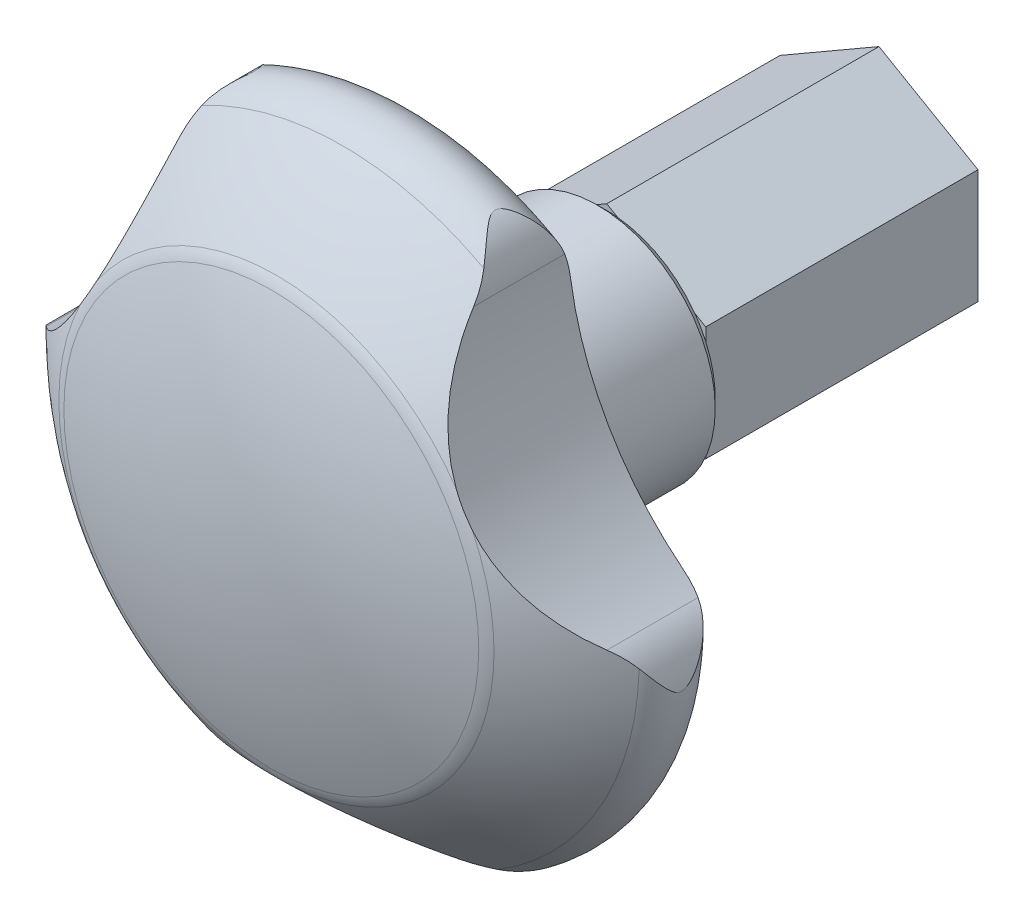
ISO-10303-21;
HEADER;
FILE_DESCRIPTION(('STEP AP214'),'2;1');
FILE_NAME('part.step','',(''),(''),'','','');
FILE_SCHEMA(('AUTOMOTIVE_DESIGN { 1 0 10303 214 1 1 1 1 }'));
ENDSEC;
DATA;
#1=APPLICATION_CONTEXT('core data for automotive mechanical design processes');
#2=APPLICATION_PROTOCOL_DEFINITION('international standard','automotive_design',2000,#1);
#3=PRODUCT_CONTEXT('',#1,'mechanical');
#4=PRODUCT('Part','Part','',(#3));
#5=PRODUCT_RELATED_PRODUCT_CATEGORY('part','',(#4));
#6=PRODUCT_DEFINITION_FORMATION('','',#4);
#7=PRODUCT_DEFINITION_CONTEXT('part definition',#1,'design');
#8=PRODUCT_DEFINITION('design','',#6,#7);
#9=PRODUCT_DEFINITION_SHAPE('','',#8);
#10=(LENGTH_UNIT() NAMED_UNIT(*) SI_UNIT(.MILLI.,.METRE.));
#11=(NAMED_UNIT(*) PLANE_ANGLE_UNIT() SI_UNIT($,.RADIAN.));
#12=(NAMED_UNIT(*) SI_UNIT($,.STERADIAN.) SOLID_ANGLE_UNIT());
#13=UNCERTAINTY_MEASURE_WITH_UNIT(LENGTH_MEASURE(1.E-05),#10,'distance_accuracy_value','');
#14=(GEOMETRIC_REPRESENTATION_CONTEXT(3) GLOBAL_UNCERTAINTY_ASSIGNED_CONTEXT((#13)) GLOBAL_UNIT_ASSIGNED_CONTEXT((#10,
#11,#12)) REPRESENTATION_CONTEXT('',''));
#15=CARTESIAN_POINT('',(0.,0.,0.));
#16=DIRECTION('',(0.,0.,1.));
#17=DIRECTION('',(1.,0.,0.));
#18=AXIS2_PLACEMENT_3D('',#15,#16,#17);
#19=CARTESIAN_POINT('',(0.,9.25,22.));
#20=DIRECTION('',(0.,0.,-1.));
#21=DIRECTION('',(-1.,0.,0.));
#22=AXIS2_PLACEMENT_3D('',#19,#20,#21);
#23=PLANE('',#22);
#24=DIRECTION('',(0.,-1.,0.));
#25=VECTOR('',#24,1.);
#26=CARTESIAN_POINT('',(-8.,4.61880215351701,22.));
#27=LINE('',#26,#25);
#28=CARTESIAN_POINT('',(-8.,4.61880215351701,22.));
#29=VERTEX_POINT('',#28);
#30=CARTESIAN_POINT('',(-8.,3.58530953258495,22.));
#31=VERTEX_POINT('',#30);
#32=EDGE_CURVE('E217',#29,#31,#27,.T.);
#33=ORIENTED_EDGE('',*,*,#32,.T.);
#34=CARTESIAN_POINT('',(0.,0.,22.));
#35=DIRECTION('',(0.,0.,1.));
#36=DIRECTION('',(1.,0.,0.));
#37=AXIS2_PLACEMENT_3D('',#34,#35,#36);
#38=CIRCLE('',#37,8.76666666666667);
#39=CARTESIAN_POINT('',(-7.10496913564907,5.13554846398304,22.));
#40=VERTEX_POINT('',#39);
#41=EDGE_CURVE('E554',#40,#31,#38,.T.);
#42=ORIENTED_EDGE('',*,*,#41,.F.);
#43=DIRECTION('',(-0.866025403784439,-0.5,0.));
#44=VECTOR('',#43,1.);
#45=CARTESIAN_POINT('',(0.,9.23760430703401,22.));
#46=LINE('',#45,#44);
#47=EDGE_CURVE('E251',#40,#29,#46,.T.);
#48=ORIENTED_EDGE('',*,*,#47,.T.);
#49=EDGE_LOOP('',(#33,#42,#48));
#50=FACE_BOUND('',#49,.T.);
#51=ADVANCED_FACE('F14',(#50),#23,.F.);
#52=DIRECTION('',(-0.866025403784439,0.5,0.));
#53=VECTOR('',#52,1.);
#54=CARTESIAN_POINT('',(8.,4.61880215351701,22.));
#55=LINE('',#54,#53);
#56=CARTESIAN_POINT('',(0.895030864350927,8.72085799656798,22.));
#57=VERTEX_POINT('',#56);
#58=CARTESIAN_POINT('',(0.,9.23760430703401,22.));
#59=VERTEX_POINT('',#58);
#60=EDGE_CURVE('E247',#57,#59,#55,.T.);
#61=ORIENTED_EDGE('',*,*,#60,.T.);
#62=CARTESIAN_POINT('',(-0.895030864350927,8.72085799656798,22.));
#63=VERTEX_POINT('',#62);
#64=EDGE_CURVE('E253',#59,#63,#46,.T.);
#65=ORIENTED_EDGE('',*,*,#64,.T.);
#66=EDGE_CURVE('E547',#57,#63,#38,.T.);
#67=ORIENTED_EDGE('',*,*,#66,.F.);
#68=EDGE_LOOP('',(#61,#65,#67));
#69=FACE_BOUND('',#68,.T.);
#70=ADVANCED_FACE('F612',(#69),#23,.F.);
#71=CARTESIAN_POINT('',(8.,4.61880215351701,22.));
#72=VERTEX_POINT('',#71);
#73=CARTESIAN_POINT('',(7.10496913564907,5.13554846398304,22.));
#74=VERTEX_POINT('',#73);
#75=EDGE_CURVE('E248',#72,#74,#55,.T.);
#76=ORIENTED_EDGE('',*,*,#75,.T.);
#77=CARTESIAN_POINT('',(8.,3.58530953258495,22.));
#78=VERTEX_POINT('',#77);
#79=EDGE_CURVE('E555',#78,#74,#38,.T.);
#80=ORIENTED_EDGE('',*,*,#79,.F.);
#81=DIRECTION('',(0.,1.,0.));
#82=VECTOR('',#81,1.);
#83=CARTESIAN_POINT('',(8.,-4.61880215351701,22.));
#84=LINE('',#83,#82);
#85=EDGE_CURVE('E242',#78,#72,#84,.T.);
#86=ORIENTED_EDGE('',*,*,#85,.T.);
#87=EDGE_LOOP('',(#76,#80,#86));
#88=FACE_BOUND('',#87,.T.);
#89=ADVANCED_FACE('F616',(#88),#23,.F.);
#90=CARTESIAN_POINT('',(8.,-4.61880215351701,22.));
#91=VERTEX_POINT('',#90);
#92=CARTESIAN_POINT('',(8.,-3.58530953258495,22.));
#93=VERTEX_POINT('',#92);
#94=EDGE_CURVE('E244',#91,#93,#84,.T.);
#95=ORIENTED_EDGE('',*,*,#94,.T.);
#96=CARTESIAN_POINT('',(7.10496913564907,-5.13554846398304,22.));
#97=VERTEX_POINT('',#96);
#98=EDGE_CURVE('E560',#97,#93,#38,.T.);
#99=ORIENTED_EDGE('',*,*,#98,.F.);
#100=DIRECTION('',(0.866025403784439,0.5,0.));
#101=VECTOR('',#100,1.);
#102=CARTESIAN_POINT('',(0.,-9.23760430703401,22.));
#103=LINE('',#102,#101);
#104=EDGE_CURVE('E238',#97,#91,#103,.T.);
#105=ORIENTED_EDGE('',*,*,#104,.T.);
#106=EDGE_LOOP('',(#95,#99,#105));
#107=FACE_BOUND('',#106,.T.);
#108=ADVANCED_FACE('F625',(#107),#23,.F.);
#109=CARTESIAN_POINT('',(0.,-9.23760430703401,22.));
#110=VERTEX_POINT('',#109);
#111=CARTESIAN_POINT('',(0.895030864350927,-8.72085799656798,22.));
#112=VERTEX_POINT('',#111);
#113=EDGE_CURVE('E206',#110,#112,#103,.T.);
#114=ORIENTED_EDGE('',*,*,#113,.T.);
#115=CARTESIAN_POINT('',(-0.895030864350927,-8.72085799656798,22.));
#116=VERTEX_POINT('',#115);
#117=EDGE_CURVE('E565',#116,#112,#38,.T.);
#118=ORIENTED_EDGE('',*,*,#117,.F.);
#119=DIRECTION('',(0.866025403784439,-0.5,0.));
#120=VECTOR('',#119,1.);
#121=CARTESIAN_POINT('',(-8.,-4.61880215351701,22.));
#122=LINE('',#121,#120);
#123=EDGE_CURVE('E240',#116,#110,#122,.T.);
#124=ORIENTED_EDGE('',*,*,#123,.T.);
#125=EDGE_LOOP('',(#114,#118,#124));
#126=FACE_BOUND('',#125,.T.);
#127=ADVANCED_FACE('F620',(#126),#23,.F.);
#128=CARTESIAN_POINT('',(-8.,-3.58530953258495,22.));
#129=VERTEX_POINT('',#128);
#130=CARTESIAN_POINT('',(-8.,-4.61880215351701,22.));
#131=VERTEX_POINT('',#130);
#132=EDGE_CURVE('E256',#129,#131,#27,.T.);
#133=ORIENTED_EDGE('',*,*,#132,.T.);
#134=CARTESIAN_POINT('',(-7.10496913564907,-5.13554846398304,22.));
#135=VERTEX_POINT('',#134);
#136=EDGE_CURVE('E235',#131,#135,#122,.T.);
#137=ORIENTED_EDGE('',*,*,#136,.T.);
#138=EDGE_CURVE('E570',#129,#135,#38,.T.);
#139=ORIENTED_EDGE('',*,*,#138,.F.);
#140=EDGE_LOOP('',(#133,#137,#139));
#141=FACE_BOUND('',#140,.T.);
#142=ADVANCED_FACE('F587',(#141),#23,.F.);
#143=CARTESIAN_POINT('',(0.,0.,40.75));
#144=DIRECTION('',(0.,0.,1.));
#145=DIRECTION('',(1.,0.,0.));
#146=AXIS2_PLACEMENT_3D('',#143,#144,#145);
#147=TOROIDAL_SURFACE('',#146,21.25,3.75);
#148=CARTESIAN_POINT('',(0.,0.,37.));
#149=DIRECTION('',(0.,0.,1.));
#150=DIRECTION('',(1.,0.,0.));
#151=AXIS2_PLACEMENT_3D('',#148,#149,#150);
#152=CIRCLE('',#151,21.25);
#153=CARTESIAN_POINT('',(9.08599745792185,-19.2095588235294,37.));
#154=VERTEX_POINT('',#153);
#155=CARTESIAN_POINT('',(21.1789646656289,1.73607479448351,37.));
#156=VERTEX_POINT('',#155);
#157=EDGE_CURVE('E521',#154,#156,#152,.T.);
#158=ORIENTED_EDGE('',*,*,#157,.T.);
#159=CARTESIAN_POINT('',(15.1554445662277,8.75,40.75));
#160=CARTESIAN_POINT('',(15.1583400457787,8.74498488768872,40.7465048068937));
#161=CARTESIAN_POINT('',(15.1612372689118,8.73997077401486,40.7430096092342));
#162=CARTESIAN_POINT('',(15.3004037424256,8.49931349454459,40.5752211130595));
#163=CARTESIAN_POINT('',(15.440528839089,8.2658685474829,40.4109385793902));
#164=CARTESIAN_POINT('',(15.7289792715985,7.8026850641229,40.084348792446));
#165=CARTESIAN_POINT('',(15.8773048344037,7.57294663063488,39.9220415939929));
#166=CARTESIAN_POINT('',(16.1829829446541,7.11622865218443,39.6011970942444));
#167=CARTESIAN_POINT('',(16.3403476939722,6.88925336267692,39.4426653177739));
#168=CARTESIAN_POINT('',(16.6646219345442,6.43788004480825,39.1318173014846));
#169=CARTESIAN_POINT('',(16.8315307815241,6.21348184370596,38.9795006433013));
#170=CARTESIAN_POINT('',(17.1751404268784,5.7675844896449,38.6840270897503));
#171=CARTESIAN_POINT('',(17.3518078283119,5.5460783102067,38.5408421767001));
#172=CARTESIAN_POINT('',(17.7162904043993,5.10497579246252,38.2659140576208));
#173=CARTESIAN_POINT('',(17.9041079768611,4.88537987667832,38.1341733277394));
#174=CARTESIAN_POINT('',(18.2911215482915,4.44877375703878,37.8858938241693));
#175=CARTESIAN_POINT('',(18.4902859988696,4.23175823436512,37.7693156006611));
#176=CARTESIAN_POINT('',(18.9009635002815,3.80020306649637,37.5550818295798));
#177=CARTESIAN_POINT('',(19.1124678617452,3.58566180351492,37.4574131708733));
#178=CARTESIAN_POINT('',(19.4685064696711,3.23761695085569,37.3172524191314));
#179=CARTESIAN_POINT('',(19.6092876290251,3.10313373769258,37.2676363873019));
#180=CARTESIAN_POINT('',(19.8958619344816,2.83579563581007,37.1795112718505));
#181=CARTESIAN_POINT('',(20.0416554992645,2.70294088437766,37.1410031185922));
#182=CARTESIAN_POINT('',(20.3372590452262,2.43997889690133,37.0769376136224));
#183=CARTESIAN_POINT('',(20.4870470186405,2.30986170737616,37.0513204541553));
#184=CARTESIAN_POINT('',(20.7907586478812,2.05236733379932,37.0146179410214));
#185=CARTESIAN_POINT('',(20.9446819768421,1.92498993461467,37.0035314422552));
#186=CARTESIAN_POINT('',(21.2269042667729,1.69710201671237,36.9984199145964));
#187=CARTESIAN_POINT('',(21.3546638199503,1.59598831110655,37.0016130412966));
#188=CARTESIAN_POINT('',(21.6115378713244,1.39673032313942,37.020101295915));
#189=CARTESIAN_POINT('',(21.7406515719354,1.29858441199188,37.0353896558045));
#190=CARTESIAN_POINT('',(22.0008735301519,1.10471730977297,37.0794596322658));
#191=CARTESIAN_POINT('',(22.1319873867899,1.00903821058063,37.1083978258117));
#192=CARTESIAN_POINT('',(22.3935585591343,0.821945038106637,37.1809641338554));
#193=CARTESIAN_POINT('',(22.5240141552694,0.730539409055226,37.2246200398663));
#194=CARTESIAN_POINT('',(22.6533171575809,0.64176588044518,37.2761534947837));
#195=B_SPLINE_CURVE_WITH_KNOTS('',3,(#159,#160,#161,#162,#163,#164,#165,#166,#167,#168,#169,
#170,#171,#172,#173,#174,#175,#176,#177,#178,#179,#180,#181,#182,#183,#184,#185,#186,#187,#188,
#189,#190,#191,#192,#193,#194),.UNSPECIFIED.,.F.,.F.,(4,2,2,2,2,2,2,2,2,2,2,2,2,2,2,2,2,4),(0.,
0.0202919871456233,0.974127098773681,1.92798862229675,2.8831694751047,3.83828592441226,
4.79031492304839,5.74254939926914,6.69225455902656,7.64129885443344,8.24373030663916,
8.84621220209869,9.44587249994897,10.0454855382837,10.5339430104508,11.0221273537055,
11.5160531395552,12.0109168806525),.UNSPECIFIED.);
#196=CARTESIAN_POINT('',(22.653117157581,0.641903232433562,37.2760737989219));
#197=VERTEX_POINT('',#196);
#198=EDGE_CURVE('E370',#156,#197,#195,.T.);
#199=ORIENTED_EDGE('',*,*,#198,.T.);
#200=CARTESIAN_POINT('',(23.9562153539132,-0.666781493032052,43.3362324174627));
#201=CARTESIAN_POINT('',(24.0326182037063,-0.779040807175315,43.2527113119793));
#202=CARTESIAN_POINT('',(24.1034851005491,-0.893029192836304,43.1665460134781));
#203=CARTESIAN_POINT('',(24.2344319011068,-1.12332188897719,42.9892190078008));
#204=CARTESIAN_POINT('',(24.2945108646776,-1.23962640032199,42.8980568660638));
#205=CARTESIAN_POINT('',(24.4035969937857,-1.47220267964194,42.711992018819));
#206=CARTESIAN_POINT('',(24.4527103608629,-1.58846279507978,42.6171366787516));
#207=CARTESIAN_POINT('',(24.5409133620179,-1.8207361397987,42.42266691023));
#208=CARTESIAN_POINT('',(24.5800066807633,-1.93674944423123,42.3230542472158));
#209=CARTESIAN_POINT('',(24.6402127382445,-2.13876860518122,42.142949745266));
#210=CARTESIAN_POINT('',(24.663387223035,-2.2252394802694,42.0636672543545));
#211=CARTESIAN_POINT('',(24.7044252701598,-2.39584370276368,41.9005436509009));
#212=CARTESIAN_POINT('',(24.7222650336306,-2.47996510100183,41.8166840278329));
#213=CARTESIAN_POINT('',(24.7528283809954,-2.64364796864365,41.6421320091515));
#214=CARTESIAN_POINT('',(24.7655072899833,-2.72316471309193,41.5513876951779));
#215=CARTESIAN_POINT('',(24.7807038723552,-2.83329888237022,41.4080637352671));
#216=CARTESIAN_POINT('',(24.7851273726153,-2.86842549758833,41.3591928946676));
#217=CARTESIAN_POINT('',(24.7927586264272,-2.93396075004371,41.2583363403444));
#218=CARTESIAN_POINT('',(24.7959686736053,-2.96437822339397,41.2063567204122));
#219=CARTESIAN_POINT('',(24.8008889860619,-3.0144821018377,41.1055183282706));
#220=CARTESIAN_POINT('',(24.8027388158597,-3.03504452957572,41.0571145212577));
#221=CARTESIAN_POINT('',(24.8055734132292,-3.06800460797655,40.9576248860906));
#222=CARTESIAN_POINT('',(24.8065613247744,-3.08043189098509,40.9065495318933));
#223=CARTESIAN_POINT('',(24.8076017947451,-3.09365300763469,40.811129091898));
#224=CARTESIAN_POINT('',(24.8077780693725,-3.09598202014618,40.7670046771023));
#225=CARTESIAN_POINT('',(24.8075341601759,-3.09282879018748,40.6790329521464));
#226=CARTESIAN_POINT('',(24.8071137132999,-3.08734310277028,40.6351857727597));
#227=CARTESIAN_POINT('',(24.805464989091,-3.06687973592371,40.5365627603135));
#228=CARTESIAN_POINT('',(24.8040388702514,-3.04962269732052,40.4822778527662));
#229=CARTESIAN_POINT('',(24.8001673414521,-3.00692868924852,40.3770209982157));
#230=CARTESIAN_POINT('',(24.7977179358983,-2.9814597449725,40.3260629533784));
#231=CARTESIAN_POINT('',(24.7907464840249,-2.91562430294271,40.2104467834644));
#232=CARTESIAN_POINT('',(24.7858023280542,-2.87314027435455,40.1470507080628));
#233=CARTESIAN_POINT('',(24.7739141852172,-2.78269141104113,40.0244336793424));
#234=CARTESIAN_POINT('',(24.7669655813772,-2.73471407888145,39.9652227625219));
#235=CARTESIAN_POINT('',(24.7509448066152,-2.63518542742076,39.8495922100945));
#236=CARTESIAN_POINT('',(24.7418601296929,-2.5836143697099,39.7931914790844));
#237=CARTESIAN_POINT('',(24.7215369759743,-2.47843898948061,39.6828562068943));
#238=CARTESIAN_POINT('',(24.7103005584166,-2.42483664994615,39.6289193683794));
#239=CARTESIAN_POINT('',(24.6704624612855,-2.24976068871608,39.45785955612));
#240=CARTESIAN_POINT('',(24.6374676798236,-2.12569217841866,39.3443925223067));
#241=CARTESIAN_POINT('',(24.5599799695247,-1.87541516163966,39.1237678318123));
#242=CARTESIAN_POINT('',(24.5154758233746,-1.74920468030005,39.0166164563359));
#243=CARTESIAN_POINT('',(24.4147000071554,-1.49721992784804,38.8080924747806));
#244=CARTESIAN_POINT('',(24.3584555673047,-1.3714453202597,38.7067071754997));
#245=CARTESIAN_POINT('',(24.2337992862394,-1.12172304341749,38.5094230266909));
#246=CARTESIAN_POINT('',(24.1653934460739,-0.997774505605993,38.4135215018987));
#247=CARTESIAN_POINT('',(24.0273046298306,-0.771458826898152,38.2415959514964));
#248=CARTESIAN_POINT('',(23.9593628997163,-0.668650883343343,38.164752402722));
#249=CARTESIAN_POINT('',(23.8142404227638,-0.466126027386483,38.0157740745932));
#250=CARTESIAN_POINT('',(23.7370581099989,-0.366409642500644,37.9436400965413));
#251=CARTESIAN_POINT('',(23.5735548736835,-0.171252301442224,37.804960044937));
#252=CARTESIAN_POINT('',(23.4872605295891,-0.0758000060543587,37.7383986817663));
#253=CARTESIAN_POINT('',(23.305296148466,0.11016061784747,37.6114916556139));
#254=CARTESIAN_POINT('',(23.2096290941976,0.200670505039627,37.5511440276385));
#255=CARTESIAN_POINT('',(23.0379232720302,0.350451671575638,37.4540605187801));
#256=CARTESIAN_POINT('',(22.9641817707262,0.411203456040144,37.4155347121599));
#257=CARTESIAN_POINT('',(22.8120278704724,0.52929297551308,37.3425770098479));
#258=CARTESIAN_POINT('',(22.733613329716,0.586629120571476,37.3081470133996));
#259=CARTESIAN_POINT('',(22.652917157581,0.642040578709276,37.2759941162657));
#260=B_SPLINE_CURVE_WITH_KNOTS('',3,(#200,#201,#202,#203,#204,#205,#206,#207,#208,#209,#210,
#211,#212,#213,#214,#215,#216,#217,#218,#219,#220,#221,#222,#223,#224,#225,#226,#227,#228,#229,
#230,#231,#232,#233,#234,#235,#236,#237,#238,#239,#240,#241,#242,#243,#244,#245,#246,#247,#248,
#249,#250,#251,#252,#253,#254,#255,#256,#257,#258,#259),.UNSPECIFIED.,.F.,.F.,(4,2,2,2,2,2,2,2,
2,2,2,2,2,2,2,2,2,2,2,2,2,2,2,2,2,2,2,2,2,4),(0.,0.478066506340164,0.956174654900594,
1.42942941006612,1.90250988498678,2.26105820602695,2.62118297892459,2.98436206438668,
3.16522841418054,3.34575116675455,3.50311745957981,3.65990730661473,3.79177502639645,
3.92370089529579,4.09363538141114,4.26423970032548,4.49308748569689,4.7224666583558,
4.9532237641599,5.18376112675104,5.69710734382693,6.21095577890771,6.7236253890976,
7.23604272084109,7.67134997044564,8.1067310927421,8.54087558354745,8.97488235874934,
9.2837093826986,9.59267905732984),.UNSPECIFIED.);
#261=CARTESIAN_POINT('',(23.9563984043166,-0.667050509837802,43.3360324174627));
#262=VERTEX_POINT('',#261);
#263=EDGE_CURVE('E409',#262,#197,#260,.T.);
#264=ORIENTED_EDGE('',*,*,#263,.F.);
#265=CARTESIAN_POINT('',(0.,0.,43.3360324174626));
#266=DIRECTION('',(0.,0.,1.));
#267=DIRECTION('',(1.,0.,0.));
#268=AXIS2_PLACEMENT_3D('',#265,#266,#267);
#269=CIRCLE('',#268,23.9656834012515);
#270=CARTESIAN_POINT('',(12.5558818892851,-20.4133243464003,43.3360324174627));
#271=VERTEX_POINT('',#270);
#272=EDGE_CURVE('E533',#271,#262,#269,.T.);
#273=ORIENTED_EDGE('',*,*,#272,.F.);
#274=CARTESIAN_POINT('',(10.7704540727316,-19.939031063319,37.2760010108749));
#275=CARTESIAN_POINT('',(10.9086558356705,-20.0050283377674,37.3263308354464));
#276=CARTESIAN_POINT('',(11.0480982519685,-20.0638003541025,37.3821742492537));
#277=CARTESIAN_POINT('',(11.3277657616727,-20.1673827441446,37.5031978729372));
#278=CARTESIAN_POINT('',(11.4679886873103,-20.2122212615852,37.5683588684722));
#279=CARTESIAN_POINT('',(11.7474655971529,-20.2885179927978,37.7062356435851));
#280=CARTESIAN_POINT('',(11.8867211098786,-20.320035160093,37.7789163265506));
#281=CARTESIAN_POINT('',(12.1638995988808,-20.3707269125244,37.9309548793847));
#282=CARTESIAN_POINT('',(12.3018217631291,-20.3898943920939,38.0103165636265));
#283=CARTESIAN_POINT('',(12.5919434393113,-20.41824038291,38.1847706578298));
#284=CARTESIAN_POINT('',(12.743842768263,-20.4259231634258,38.2806030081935));
#285=CARTESIAN_POINT('',(13.0435195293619,-20.427787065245,38.4786223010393));
#286=CARTESIAN_POINT('',(13.1912963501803,-20.4219661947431,38.580810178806));
#287=CARTESIAN_POINT('',(13.4812904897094,-20.3980121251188,38.7910102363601));
#288=CARTESIAN_POINT('',(13.6235149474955,-20.3798953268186,38.8990144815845));
#289=CARTESIAN_POINT('',(13.9010593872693,-20.3327283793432,39.1211871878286));
#290=CARTESIAN_POINT('',(14.0363833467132,-20.3036846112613,39.2353520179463));
#291=CARTESIAN_POINT('',(14.2507406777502,-20.2487068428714,39.4290773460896));
#292=CARTESIAN_POINT('',(14.332534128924,-20.2254029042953,39.5063383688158));
#293=CARTESIAN_POINT('',(14.4912780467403,-20.1759550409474,39.6653563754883));
#294=CARTESIAN_POINT('',(14.5682121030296,-20.1498022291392,39.7471270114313));
#295=CARTESIAN_POINT('',(14.715561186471,-20.0959194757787,39.9178762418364));
#296=CARTESIAN_POINT('',(14.7858917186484,-20.0681749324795,40.0069264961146));
#297=CARTESIAN_POINT('',(14.8809777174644,-20.0285289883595,40.1478405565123));
#298=CARTESIAN_POINT('',(14.9108788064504,-20.0156706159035,40.1959111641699));
#299=CARTESIAN_POINT('',(14.9656875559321,-19.9915548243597,40.2951518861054));
#300=CARTESIAN_POINT('',(14.9906061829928,-19.9802939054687,40.3463148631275));
#301=CARTESIAN_POINT('',(15.0303117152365,-19.9620564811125,40.4451176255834));
#302=CARTESIAN_POINT('',(15.0460096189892,-19.9547077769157,40.4923085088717));
#303=CARTESIAN_POINT('',(15.0698868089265,-19.9434458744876,40.5888820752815));
#304=CARTESIAN_POINT('',(15.0780930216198,-19.9395203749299,40.6382562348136));
#305=CARTESIAN_POINT('',(15.0855282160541,-19.9359663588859,40.7383503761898));
#306=CARTESIAN_POINT('',(15.084672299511,-19.9363784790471,40.7890786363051));
#307=CARTESIAN_POINT('',(15.0739589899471,-19.9414927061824,40.889382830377));
#308=CARTESIAN_POINT('',(15.064082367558,-19.9462039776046,40.9389560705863));
#309=CARTESIAN_POINT('',(15.0330474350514,-19.9607791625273,41.0502572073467));
#310=CARTESIAN_POINT('',(15.0093721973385,-19.971774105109,41.1110985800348));
#311=CARTESIAN_POINT('',(14.9540281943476,-19.9967550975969,41.2284300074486));
#312=CARTESIAN_POINT('',(14.9223250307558,-20.0107539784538,41.2848999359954));
#313=CARTESIAN_POINT('',(14.8348377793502,-20.048100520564,41.4245424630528));
#314=CARTESIAN_POINT('',(14.7754462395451,-20.0723291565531,41.5051665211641));
#315=CARTESIAN_POINT('',(14.6495558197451,-20.1205404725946,41.6608254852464));
#316=CARTESIAN_POINT('',(14.5830399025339,-20.1445224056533,41.7358462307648));
#317=CARTESIAN_POINT('',(14.4447826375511,-20.1908743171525,41.8823943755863));
#318=CARTESIAN_POINT('',(14.3730102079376,-20.2132328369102,41.9538959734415));
#319=CARTESIAN_POINT('',(14.225935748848,-20.2552915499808,42.0938014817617));
#320=CARTESIAN_POINT('',(14.1506373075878,-20.2749943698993,42.1622084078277));
#321=CARTESIAN_POINT('',(13.9561680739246,-20.3209136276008,42.3324653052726));
#322=CARTESIAN_POINT('',(13.8350387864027,-20.34499093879,42.4326698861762));
#323=CARTESIAN_POINT('',(13.5875110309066,-20.3844246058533,42.6282828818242));
#324=CARTESIAN_POINT('',(13.4611098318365,-20.3997763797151,42.723688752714));
#325=CARTESIAN_POINT('',(13.2065858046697,-20.4206049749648,42.9080353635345));
#326=CARTESIAN_POINT('',(13.0785430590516,-20.4262663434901,42.99706524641));
#327=CARTESIAN_POINT('',(12.8192577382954,-20.4275210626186,43.1703181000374));
#328=CARTESIAN_POINT('',(12.6880160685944,-20.4231172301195,43.2545424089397));
#329=CARTESIAN_POINT('',(12.5555573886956,-20.4133003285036,43.3362324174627));
#330=B_SPLINE_CURVE_WITH_KNOTS('',3,(#274,#275,#276,#277,#278,#279,#280,#281,#282,#283,#284,
#285,#286,#287,#288,#289,#290,#291,#292,#293,#294,#295,#296,#297,#298,#299,#300,#301,#302,#303,
#304,#305,#306,#307,#308,#309,#310,#311,#312,#313,#314,#315,#316,#317,#318,#319,#320,#321,#322,
#323,#324,#325,#326,#327,#328,#329),.UNSPECIFIED.,.F.,.F.,(4,2,2,2,2,2,2,2,2,2,2,2,2,2,2,2,2,2,
2,2,2,2,2,2,2,2,2,4),(0.,0.483118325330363,0.965254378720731,1.44523381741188,1.92548917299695,
2.46406656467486,3.00272340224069,3.54066316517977,4.07828927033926,4.42280829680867,
4.76843461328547,5.11800857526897,5.2919641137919,5.46553245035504,5.615803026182,
5.76553135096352,5.91666363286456,6.06811883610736,6.26561792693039,6.46397802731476,
6.772286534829,7.08134952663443,7.39241624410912,7.70317300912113,8.1798529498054,
8.65678297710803,9.12452475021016,9.59213563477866),.UNSPECIFIED.);
#331=CARTESIAN_POINT('',(10.7706540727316,-19.9391265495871,37.2760737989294));
#332=VERTEX_POINT('',#331);
#333=EDGE_CURVE('E402',#332,#271,#330,.T.);
#334=ORIENTED_EDGE('',*,*,#333,.F.);
#335=CARTESIAN_POINT('',(0.,-17.5,40.75));
#336=CARTESIAN_POINT('',(0.00579095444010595,-17.5000000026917,40.7465048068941));
#337=CARTESIAN_POINT('',(0.0115819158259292,-17.5000020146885,40.743009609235));
#338=CARTESIAN_POINT('',(0.289580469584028,-17.5001950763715,40.5752211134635));
#339=CARTESIAN_POINT('',(0.561812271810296,-17.5048244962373,40.4109385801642));
#340=CARTESIAN_POINT('',(1.10716614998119,-17.5230381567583,40.0843487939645));
#341=CARTESIAN_POINT('',(1.38028825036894,-17.5366226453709,39.9220415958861));
#342=CARTESIAN_POINT('',(1.92865667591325,-17.5729886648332,39.6011970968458));
#343=CARTESIAN_POINT('',(2.20390541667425,-17.5957828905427,39.442665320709));
#344=CARTESIAN_POINT('',(2.75694329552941,-17.6509259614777,39.1318173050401));
#345=CARTESIAN_POINT('',(3.03473226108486,-17.6832741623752,38.9795006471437));
#346=CARTESIAN_POINT('',(3.59269551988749,-17.7579001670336,38.6840270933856));
#347=CARTESIAN_POINT('',(3.87285919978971,-17.8001455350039,38.5408421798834));
#348=CARTESIAN_POINT('',(4.43710647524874,-17.8952454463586,38.2659140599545));
#349=CARTESIAN_POINT('',(4.7211909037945,-17.9481022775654,38.1341733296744));
#350=CARTESIAN_POINT('',(5.29280968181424,-18.0649628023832,37.8858938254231));
#351=CARTESIAN_POINT('',(5.58033286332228,-18.1289365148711,37.7693156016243));
#352=CARTESIAN_POINT('',(6.15940935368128,-18.268816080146,37.5550818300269));
#353=CARTESIAN_POINT('',(6.4509597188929,-18.3447135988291,37.4574131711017));
#354=CARTESIAN_POINT('',(6.93039509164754,-18.4790297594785,37.3172523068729));
#355=CARTESIAN_POINT('',(7.11725193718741,-18.5337083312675,37.2676361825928));
#356=CARTESIAN_POINT('',(7.49206145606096,-18.6482201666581,37.1795109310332));
#357=CARTESIAN_POINT('',(7.68001421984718,-18.7080538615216,37.1410027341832));
#358=CARTESIAN_POINT('',(8.05554853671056,-18.8325733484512,37.0769372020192));
#359=CARTESIAN_POINT('',(8.24312770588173,-18.8972351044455,37.0513200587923));
#360=CARTESIAN_POINT('',(8.61798096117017,-19.0315102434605,37.0146176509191));
#361=CARTESIAN_POINT('',(8.80525507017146,-19.1011232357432,37.0035312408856));
#362=CARTESIAN_POINT('',(9.14372123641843,-19.2315903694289,36.9984199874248));
#363=CARTESIAN_POINT('',(9.29516598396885,-19.2916757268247,37.0016131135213));
#364=CARTESIAN_POINT('',(9.59616141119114,-19.4145044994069,37.0201010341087));
#365=CARTESIAN_POINT('',(9.74571310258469,-19.4772464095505,37.0353890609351));
#366=CARTESIAN_POINT('',(10.0437139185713,-19.6056698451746,37.0794579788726));
#367=CARTESIAN_POINT('',(10.1921293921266,-19.6713772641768,37.108395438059));
#368=CARTESIAN_POINT('',(10.4849385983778,-19.8043560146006,37.1809598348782));
#369=CARTESIAN_POINT('',(10.6293241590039,-19.8716300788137,37.2246145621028));
#370=CARTESIAN_POINT('',(10.7708540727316,-19.9392220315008,37.2761465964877));
#371=B_SPLINE_CURVE_WITH_KNOTS('',3,(#335,#336,#337,#338,#339,#340,#341,#342,#343,#344,#345,
#346,#347,#348,#349,#350,#351,#352,#353,#354,#355,#356,#357,#358,#359,#360,#361,#362,#363,#364,
#365,#366,#367,#368,#369,#370),.UNSPECIFIED.,.F.,.F.,(4,2,2,2,2,2,2,2,2,2,2,2,2,2,2,2,2,4),(0.,
0.0202919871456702,0.974127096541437,1.92798861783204,2.88316946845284,3.83828591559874,
4.79031491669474,5.74254939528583,6.69225455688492,7.64129885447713,8.24373154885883,
8.84621468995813,9.44587623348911,10.045490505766,10.5339413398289,11.0221190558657,
11.5160379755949,12.0108948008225),.UNSPECIFIED.);
#372=EDGE_CURVE('E330',#332,#154,#371,.F.);
#373=ORIENTED_EDGE('',*,*,#372,.T.);
#374=EDGE_LOOP('',(#158,#199,#264,#273,#334,#373));
#375=FACE_BOUND('',#374,.T.);
#376=ADVANCED_FACE('F344',(#375),#147,.T.);
#377=CARTESIAN_POINT('',(-22.652917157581,0.64204057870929,37.2759941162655));
#378=CARTESIAN_POINT('',(-22.7791739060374,0.555353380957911,37.326323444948));
#379=CARTESIAN_POINT('',(-22.8997937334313,0.463979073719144,37.3821664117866));
#380=CARTESIAN_POINT('',(-23.1293335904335,0.273571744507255,37.5031892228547));
#381=CARTESIAN_POINT('',(-23.2382769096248,0.174554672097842,37.5683498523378));
#382=CARTESIAN_POINT('',(-23.4440913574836,-0.0293305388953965,37.7062259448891));
#383=CARTESIAN_POINT('',(-23.5410143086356,-0.134170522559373,37.7789063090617));
#384=CARTESIAN_POINT('',(-23.7235049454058,-0.348867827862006,37.9309442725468));
#385=CARTESIAN_POINT('',(-23.80906607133,-0.458727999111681,38.0103056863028));
#386=CARTESIAN_POINT('',(-23.9786761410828,-0.69580711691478,38.1847590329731));
#387=CARTESIAN_POINT('',(-24.0612796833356,-0.823513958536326,38.280590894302));
#388=CARTESIAN_POINT('',(-24.2127330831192,-1.08210885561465,38.4786092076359));
#389=CARTESIAN_POINT('',(-24.2815809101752,-1.21299737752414,38.5807965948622));
#390=CARTESIAN_POINT('',(-24.4058340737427,-1.47611600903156,38.7909956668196));
#391=CARTESIAN_POINT('',(-24.4612571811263,-1.60834410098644,38.8989994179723));
#392=CARTESIAN_POINT('',(-24.5591826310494,-1.87228762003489,39.1211710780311));
#393=CARTESIAN_POINT('',(-24.6016924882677,-2.00400330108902,39.2353353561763));
#394=CARTESIAN_POINT('',(-24.6612601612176,-2.21713195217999,39.4290605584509));
#395=CARTESIAN_POINT('',(-24.6819756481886,-2.29962010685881,39.5063220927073));
#396=CARTESIAN_POINT('',(-24.7185255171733,-2.46182231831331,39.6653410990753));
#397=CARTESIAN_POINT('',(-24.7343439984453,-2.54152660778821,39.7471122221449));
#398=CARTESIAN_POINT('',(-24.7613555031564,-2.69607819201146,39.9178623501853));
#399=CARTESIAN_POINT('',(-24.7724936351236,-2.77085961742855,40.0069130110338));
#400=CARTESIAN_POINT('',(-24.7857026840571,-2.87303137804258,40.1478276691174));
#401=CARTESIAN_POINT('',(-24.7895176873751,-2.90535633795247,40.1958984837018));
#402=CARTESIAN_POINT('',(-24.7960374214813,-2.96488143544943,40.2951396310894));
#403=CARTESIAN_POINT('',(-24.7987446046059,-2.99209281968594,40.3463028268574));
#404=CARTESIAN_POINT('',(-24.8028034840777,-3.03559903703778,40.4451060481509));
#405=CARTESIAN_POINT('',(-24.8042883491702,-3.05286890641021,40.4922971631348));
#406=CARTESIAN_POINT('',(-24.806473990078,-3.07917959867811,40.5888712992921));
#407=CARTESIAN_POINT('',(-24.8071775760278,-3.0882498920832,40.6382457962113));
#408=CARTESIAN_POINT('',(-24.8078174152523,-3.09646736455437,40.7383408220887));
#409=CARTESIAN_POINT('',(-24.8077464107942,-3.09552068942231,40.7890696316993));
#410=CARTESIAN_POINT('',(-24.8068188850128,-3.08368654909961,40.889374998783));
#411=CARTESIAN_POINT('',(-24.805960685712,-3.07277784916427,40.9389488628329));
#412=CARTESIAN_POINT('',(-24.8030657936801,-3.03861415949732,41.0502498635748));
#413=CARTESIAN_POINT('',(-24.8007501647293,-3.01261416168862,41.1110905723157));
#414=CARTESIAN_POINT('',(-24.7947125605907,-2.95219604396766,41.2284207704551));
#415=CARTESIAN_POINT('',(-24.7909844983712,-2.91774171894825,41.2848901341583));
#416=CARTESIAN_POINT('',(-24.7795843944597,-2.82330501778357,41.4245304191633));
#417=CARTESIAN_POINT('',(-24.7708716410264,-2.75975811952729,41.5051529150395));
#418=CARTESIAN_POINT('',(-24.7496796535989,-2.62663219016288,41.6608088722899));
#419=CARTESIAN_POINT('',(-24.7371912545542,-2.5570387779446,41.7358281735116));
#420=CARTESIAN_POINT('',(-24.7082059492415,-2.41413255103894,41.8823735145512));
#421=CARTESIAN_POINT('',(-24.6916835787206,-2.34079854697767,41.9538737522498));
#422=CARTESIAN_POINT('',(-24.6545720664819,-2.19240293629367,42.0937766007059));
#423=CARTESIAN_POINT('',(-24.6339869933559,-2.11734312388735,42.1621822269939));
#424=CARTESIAN_POINT('',(-24.5765208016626,-1.92596765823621,42.3324407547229));
#425=CARTESIAN_POINT('',(-24.5368075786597,-1.80902532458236,42.4326480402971));
#426=CARTESIAN_POINT('',(-24.4471935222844,-1.57493778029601,42.6282662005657));
#427=CARTESIAN_POINT('',(-24.3972873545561,-1.45779249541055,42.7236745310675));
#428=CARTESIAN_POINT('',(-24.2880618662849,-1.22694864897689,42.9080256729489));
#429=CARTESIAN_POINT('',(-24.2289424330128,-1.11322716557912,42.9970576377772));
#430=CARTESIAN_POINT('',(-24.1003840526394,-0.888047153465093,43.1703144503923));
#431=CARTESIAN_POINT('',(-24.0309479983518,-0.776588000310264,43.2545406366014));
#432=CARTESIAN_POINT('',(-23.9562153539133,-0.666781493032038,43.3362324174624));
#433=B_SPLINE_CURVE_WITH_KNOTS('',3,(#377,#378,#379,#380,#381,#382,#383,#384,#385,#386,#387,
#388,#389,#390,#391,#392,#393,#394,#395,#396,#397,#398,#399,#400,#401,#402,#403,#404,#405,#406,
#407,#408,#409,#410,#411,#412,#413,#414,#415,#416,#417,#418,#419,#420,#421,#422,#423,#424,#425,
#426,#427,#428,#429,#430,#431,#432),.UNSPECIFIED.,.F.,.F.,(4,2,2,2,2,2,2,2,2,2,2,2,2,2,2,2,2,2,
2,2,2,2,2,2,2,2,2,4),(0.,0.483118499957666,0.965254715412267,1.44523419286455,1.92548959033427,
2.46406579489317,3.00272143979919,3.54066009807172,4.07828510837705,4.42280757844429,
4.7684372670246,5.11801444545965,5.29197165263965,5.46554166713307,5.61581366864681,
5.76554339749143,5.91667725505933,6.06813401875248,6.26563030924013,6.46398759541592,
6.77228864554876,7.08134416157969,7.39240344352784,7.70315278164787,8.17984372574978,
8.65678478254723,9.12453669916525,9.59215770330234),.UNSPECIFIED.);
#434=CARTESIAN_POINT('',(-22.653117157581,0.641903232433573,37.2760737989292));
#435=VERTEX_POINT('',#434);
#436=CARTESIAN_POINT('',(-23.9563984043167,-0.667050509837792,43.3360324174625));
#437=VERTEX_POINT('',#436);
#438=EDGE_CURVE('E428',#435,#437,#433,.T.);
#439=ORIENTED_EDGE('',*,*,#438,.F.);
#440=CARTESIAN_POINT('',(-15.1554445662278,8.75,40.75));
#441=CARTESIAN_POINT('',(-15.1583400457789,8.74498488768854,40.746504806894));
#442=CARTESIAN_POINT('',(-15.1612372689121,8.7399707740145,40.7430096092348));
#443=CARTESIAN_POINT('',(-15.3004037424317,8.49931349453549,40.5752211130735));
#444=CARTESIAN_POINT('',(-15.4405288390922,8.26586854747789,40.4109385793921));
#445=CARTESIAN_POINT('',(-15.728979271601,7.80268506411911,40.0843487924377));
#446=CARTESIAN_POINT('',(-15.8773048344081,7.57294663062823,39.9220415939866));
#447=CARTESIAN_POINT('',(-16.1829829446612,7.11622865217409,39.6011970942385));
#448=CARTESIAN_POINT('',(-16.3403476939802,6.88925336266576,39.4426653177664));
#449=CARTESIAN_POINT('',(-16.6646219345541,6.43788004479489,39.131817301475));
#450=CARTESIAN_POINT('',(-16.8315307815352,6.21348184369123,38.9795006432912));
#451=CARTESIAN_POINT('',(-17.1751404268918,5.76758448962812,38.6840270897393));
#452=CARTESIAN_POINT('',(-17.3518078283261,5.54607831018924,38.5408421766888));
#453=CARTESIAN_POINT('',(-17.7162904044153,5.10497579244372,38.2659140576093));
#454=CARTESIAN_POINT('',(-17.904107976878,4.88537987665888,38.1341733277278));
#455=CARTESIAN_POINT('',(-18.2911215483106,4.44877375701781,37.8858938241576));
#456=CARTESIAN_POINT('',(-18.49028599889,4.2317582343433,37.7693156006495));
#457=CARTESIAN_POINT('',(-18.9009635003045,3.80020306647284,37.5550818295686));
#458=CARTESIAN_POINT('',(-19.1124678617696,3.58566180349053,37.4574131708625));
#459=CARTESIAN_POINT('',(-19.4685064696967,3.23761695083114,37.317252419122));
#460=CARTESIAN_POINT('',(-19.6092876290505,3.10313373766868,37.2676363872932));
#461=CARTESIAN_POINT('',(-19.8958619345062,2.83579563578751,37.1795112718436));
#462=CARTESIAN_POINT('',(-20.0416554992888,2.7029408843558,37.1410031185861));
#463=CARTESIAN_POINT('',(-20.33725904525,2.43997889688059,37.0769376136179));
#464=CARTESIAN_POINT('',(-20.4870470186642,2.30986170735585,37.0513204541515));
#465=CARTESIAN_POINT('',(-20.7907586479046,2.05236733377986,37.0146179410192));
#466=CARTESIAN_POINT('',(-20.9446819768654,1.92498993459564,37.0035314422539));
#467=CARTESIAN_POINT('',(-21.2269042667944,1.6971020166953,36.9984199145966));
#468=CARTESIAN_POINT('',(-21.3546638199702,1.59598831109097,37.0016130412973));
#469=CARTESIAN_POINT('',(-21.611537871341,1.39673032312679,37.0201012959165));
#470=CARTESIAN_POINT('',(-21.7406515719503,1.2985844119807,37.0353896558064));
#471=CARTESIAN_POINT('',(-22.0008735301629,1.10471730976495,37.0794596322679));
#472=CARTESIAN_POINT('',(-22.1319873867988,1.00903821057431,37.1083978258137));
#473=CARTESIAN_POINT('',(-22.3935585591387,0.821945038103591,37.1809641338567));
#474=CARTESIAN_POINT('',(-22.5240141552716,0.730539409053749,37.224620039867));
#475=CARTESIAN_POINT('',(-22.653317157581,0.641765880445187,37.2761534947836));
#476=B_SPLINE_CURVE_WITH_KNOTS('',3,(#440,#441,#442,#443,#444,#445,#446,#447,#448,#449,#450,
#451,#452,#453,#454,#455,#456,#457,#458,#459,#460,#461,#462,#463,#464,#465,#466,#467,#468,#469,
#470,#471,#472,#473,#474,#475),.UNSPECIFIED.,.F.,.F.,(4,2,2,2,2,2,2,2,2,2,2,2,2,2,2,2,2,4),(0.,
0.0202919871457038,0.974127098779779,1.92798862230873,2.88316947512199,3.83828592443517,
4.79031492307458,5.74254939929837,6.69225455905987,7.6412988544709,8.24373030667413,
8.84621220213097,9.44587249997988,10.0454855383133,10.5339430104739,11.022127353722,
11.5160531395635,12.0109168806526),.UNSPECIFIED.);
#477=CARTESIAN_POINT('',(-21.178964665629,1.73607479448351,37.));
#478=VERTEX_POINT('',#477);
#479=EDGE_CURVE('E378',#435,#478,#476,.F.);
#480=ORIENTED_EDGE('',*,*,#479,.T.);
#481=CARTESIAN_POINT('',(-9.08599745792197,-19.2095588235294,37.));
#482=VERTEX_POINT('',#481);
#483=EDGE_CURVE('E526',#478,#482,#152,.T.);
#484=ORIENTED_EDGE('',*,*,#483,.T.);
#485=CARTESIAN_POINT('',(0.,-17.5,40.75));
#486=CARTESIAN_POINT('',(-0.00579095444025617,-17.5000000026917,40.7465048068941));
#487=CARTESIAN_POINT('',(-0.0115819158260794,-17.5000020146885,40.743009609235));
#488=CARTESIAN_POINT('',(-0.289580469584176,-17.5001950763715,40.5752211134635));
#489=CARTESIAN_POINT('',(-0.561812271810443,-17.5048244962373,40.4109385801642));
#490=CARTESIAN_POINT('',(-1.10716614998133,-17.5230381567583,40.0843487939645));
#491=CARTESIAN_POINT('',(-1.38028825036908,-17.5366226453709,39.9220415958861));
#492=CARTESIAN_POINT('',(-1.92865667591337,-17.5729886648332,39.6011970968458));
#493=CARTESIAN_POINT('',(-2.20390541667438,-17.5957828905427,39.4426653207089));
#494=CARTESIAN_POINT('',(-2.75694329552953,-17.6509259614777,39.1318173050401));
#495=CARTESIAN_POINT('',(-3.03473226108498,-17.6832741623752,38.9795006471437));
#496=CARTESIAN_POINT('',(-3.59269551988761,-17.7579001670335,38.6840270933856));
#497=CARTESIAN_POINT('',(-3.87285919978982,-17.8001455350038,38.5408421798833));
#498=CARTESIAN_POINT('',(-4.43710647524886,-17.8952454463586,38.2659140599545));
#499=CARTESIAN_POINT('',(-4.72119090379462,-17.9481022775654,38.1341733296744));
#500=CARTESIAN_POINT('',(-5.29280968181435,-18.0649628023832,37.8858938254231));
#501=CARTESIAN_POINT('',(-5.58033286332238,-18.128936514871,37.7693156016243));
#502=CARTESIAN_POINT('',(-6.15940935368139,-18.268816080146,37.5550818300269));
#503=CARTESIAN_POINT('',(-6.45095971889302,-18.3447135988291,37.4574131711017));
#504=CARTESIAN_POINT('',(-6.93039509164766,-18.4790297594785,37.3172523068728));
#505=CARTESIAN_POINT('',(-7.11725193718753,-18.5337083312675,37.2676361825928));
#506=CARTESIAN_POINT('',(-7.49206145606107,-18.648220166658,37.1795109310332));
#507=CARTESIAN_POINT('',(-7.68001421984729,-18.7080538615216,37.1410027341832));
#508=CARTESIAN_POINT('',(-8.05554853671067,-18.8325733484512,37.0769372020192));
#509=CARTESIAN_POINT('',(-8.24312770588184,-18.8972351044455,37.0513200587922));
#510=CARTESIAN_POINT('',(-8.61798096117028,-19.0315102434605,37.014617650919));
#511=CARTESIAN_POINT('',(-8.80525507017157,-19.1011232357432,37.0035312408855));
#512=CARTESIAN_POINT('',(-9.14372123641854,-19.2315903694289,36.9984199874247));
#513=CARTESIAN_POINT('',(-9.29516598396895,-19.2916757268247,37.0016131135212));
#514=CARTESIAN_POINT('',(-9.59616141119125,-19.4145044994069,37.0201010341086));
#515=CARTESIAN_POINT('',(-9.7457131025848,-19.4772464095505,37.035389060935));
#516=CARTESIAN_POINT('',(-10.0437139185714,-19.6056698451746,37.0794579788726));
#517=CARTESIAN_POINT('',(-10.1921293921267,-19.6713772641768,37.1083954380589));
#518=CARTESIAN_POINT('',(-10.484938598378,-19.8043560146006,37.1809598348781));
#519=CARTESIAN_POINT('',(-10.6293241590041,-19.8716300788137,37.2246145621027));
#520=CARTESIAN_POINT('',(-10.7708540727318,-19.9392220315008,37.2761465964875));
#521=B_SPLINE_CURVE_WITH_KNOTS('',3,(#485,#486,#487,#488,#489,#490,#491,#492,#493,#494,#495,
#496,#497,#498,#499,#500,#501,#502,#503,#504,#505,#506,#507,#508,#509,#510,#511,#512,#513,#514,
#515,#516,#517,#518,#519,#520),.UNSPECIFIED.,.F.,.F.,(4,2,2,2,2,2,2,2,2,2,2,2,2,2,2,2,2,4),(0.,
0.0202919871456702,0.97412709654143,1.92798861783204,2.88316946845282,3.83828591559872,
4.79031491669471,5.7425493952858,6.6922545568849,7.64129885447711,8.24373154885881,
8.84621468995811,9.44587623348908,10.0454905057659,10.5339413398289,11.0221190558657,
11.5160379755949,12.0108948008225),.UNSPECIFIED.);
#522=CARTESIAN_POINT('',(-10.7706540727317,-19.9391265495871,37.276073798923));
#523=VERTEX_POINT('',#522);
#524=EDGE_CURVE('E352',#482,#523,#521,.T.);
#525=ORIENTED_EDGE('',*,*,#524,.T.);
#526=CARTESIAN_POINT('',(-12.5555573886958,-20.4133003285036,43.3362324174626));
#527=CARTESIAN_POINT('',(-12.6909782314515,-20.4233374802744,43.2527113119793));
#528=CARTESIAN_POINT('',(-12.8251285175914,-20.4277158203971,43.1665460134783));
#529=CARTESIAN_POINT('',(-13.0900412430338,-20.425972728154,42.9892190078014));
#530=CARTESIAN_POINT('',(-13.2208033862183,-20.419850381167,42.8980568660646));
#531=CARTESIAN_POINT('',(-13.4767634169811,-20.3980336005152,42.7119920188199));
#532=CARTESIAN_POINT('',(-13.6020043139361,-20.3824369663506,42.6171366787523));
#533=CARTESIAN_POINT('',(-13.8472604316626,-20.3426863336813,42.4226669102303));
#534=CARTESIAN_POINT('',(-13.9672775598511,-20.3185354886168,42.3230542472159));
#535=CARTESIAN_POINT('',(-14.1723343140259,-20.269665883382,42.1429497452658));
#536=CARTESIAN_POINT('',(-14.2588075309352,-20.2465001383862,42.0636672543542));
#537=CARTESIAN_POINT('',(-14.4270741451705,-20.1967380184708,41.9005436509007));
#538=CARTESIAN_POINT('',(-14.5088452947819,-20.170127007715,41.8166840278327));
#539=CARTESIAN_POINT('',(-14.6658804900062,-20.1147542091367,41.6421320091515));
#540=CARTESIAN_POINT('',(-14.7410834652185,-20.0859760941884,41.551387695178));
#541=CARTESIAN_POINT('',(-14.8440607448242,-20.0440696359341,41.4080637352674));
#542=CARTESIAN_POINT('',(-14.8766930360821,-20.0303371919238,41.3591928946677));
#543=CARTESIAN_POINT('',(-14.937263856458,-20.00417842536,41.2583363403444));
#544=CARTESIAN_POINT('',(-14.9652111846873,-19.9917496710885,41.2063567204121));
#545=CARTESIAN_POINT('',(-15.011062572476,-19.9709588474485,41.1055183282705));
#546=CARTESIAN_POINT('',(-15.0297950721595,-19.962279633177,41.0571145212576));
#547=CARTESIAN_POINT('',(-15.0597566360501,-19.9482544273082,40.9576248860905));
#548=CARTESIAN_POINT('',(-15.0710129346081,-19.9428963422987,40.9065495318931));
#549=CARTESIAN_POINT('',(-15.0829829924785,-19.9371868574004,40.8111290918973));
#550=CARTESIAN_POINT('',(-15.0850881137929,-19.93617500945,40.7670046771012));
#551=CARTESIAN_POINT('',(-15.0822353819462,-19.9375403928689,40.6790329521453));
#552=CARTESIAN_POINT('',(-15.0772744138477,-19.9399191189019,40.6351857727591));
#553=CARTESIAN_POINT('',(-15.0587282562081,-19.9487229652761,40.5365627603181));
#554=CARTESIAN_POINT('',(-15.0430701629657,-19.9561164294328,40.4822778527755));
#555=CARTESIAN_POINT('',(-15.0041603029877,-19.9741105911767,40.3770209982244));
#556=CARTESIAN_POINT('',(-14.9808788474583,-19.9847238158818,40.3260629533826));
#557=CARTESIAN_POINT('',(-14.920377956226,-20.0116040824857,40.2104467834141));
#558=CARTESIAN_POINT('',(-14.8811136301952,-20.0285643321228,40.1470507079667));
#559=CARTESIAN_POINT('',(-14.7968385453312,-20.0634933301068,40.02443367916));
#560=CARTESIAN_POINT('',(-14.7518146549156,-20.0814643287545,39.9652227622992));
#561=CARTESIAN_POINT('',(-14.6576099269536,-20.1173542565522,39.8495922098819));
#562=CARTESIAN_POINT('',(-14.6084057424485,-20.1352722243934,39.7931914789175));
#563=CARTESIAN_POINT('',(-14.5071596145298,-20.1702595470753,39.6828562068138));
#564=CARTESIAN_POINT('',(-14.4551204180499,-20.1873296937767,39.6289193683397));
#565=CARTESIAN_POINT('',(-14.2835811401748,-20.240366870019,39.4578595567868));
#566=CARTESIAN_POINT('',(-14.1596372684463,-20.2738268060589,39.3443925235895));
#567=CARTESIAN_POINT('',(-13.9041471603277,-20.3318589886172,39.1237678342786));
#568=CARTESIAN_POINT('',(-13.7725936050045,-20.3564225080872,39.0166164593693));
#569=CARTESIAN_POINT('',(-13.5039805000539,-20.3951404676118,38.8080924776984));
#570=CARTESIAN_POINT('',(-13.3669342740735,-20.4093186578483,38.7067071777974));
#571=CARTESIAN_POINT('',(-13.0883402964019,-20.426224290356,38.5094230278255));
#572=CARTESIAN_POINT('',(-12.9467947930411,-20.4289573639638,38.4135215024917));
#573=CARTESIAN_POINT('',(-12.6817550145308,-20.4225267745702,38.2415957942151));
#574=CARTESIAN_POINT('',(-12.5587496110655,-20.4150914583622,38.16475209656));
#575=CARTESIAN_POINT('',(-12.310796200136,-20.3906740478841,38.0157734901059));
#576=CARTESIAN_POINT('',(-12.1858478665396,-20.3736903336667,37.9436393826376));
#577=CARTESIAN_POINT('',(-11.9350845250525,-20.3296708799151,37.804959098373));
#578=CARTESIAN_POINT('',(-11.8092729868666,-20.3026638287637,37.7383976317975));
#579=CARTESIAN_POINT('',(-11.557243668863,-20.2380581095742,37.6114904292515));
#580=CARTESIAN_POINT('',(-11.4310260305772,-20.2004628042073,37.5511427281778));
#581=CARTESIAN_POINT('',(-11.2154622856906,-20.126652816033,37.4540608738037));
#582=CARTESIAN_POINT('',(-11.1259826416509,-20.0931681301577,37.4155366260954));
#583=CARTESIAN_POINT('',(-10.9476445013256,-20.0204470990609,37.3425816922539));
#584=CARTESIAN_POINT('',(-10.8587863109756,-19.9812081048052,37.3081529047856));
#585=CARTESIAN_POINT('',(-10.7704540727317,-19.939031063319,37.2760010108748));
#586=B_SPLINE_CURVE_WITH_KNOTS('',3,(#526,#527,#528,#529,#530,#531,#532,#533,#534,#535,#536,
#537,#538,#539,#540,#541,#542,#543,#544,#545,#546,#547,#548,#549,#550,#551,#552,#553,#554,#555,
#556,#557,#558,#559,#560,#561,#562,#563,#564,#565,#566,#567,#568,#569,#570,#571,#572,#573,#574,
#575,#576,#577,#578,#579,#580,#581,#582,#583,#584,#585),.UNSPECIFIED.,.F.,.F.,(4,2,2,2,2,2,2,2,
2,2,2,2,2,2,2,2,2,2,2,2,2,2,2,2,2,2,2,2,2,4),(0.,0.478066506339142,0.956174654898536,
1.42942941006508,1.90250988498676,2.26105820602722,2.62118297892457,2.98436206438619,
3.16522841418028,3.34575116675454,3.50311745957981,3.65990730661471,3.79177502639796,
3.92370089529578,4.09363538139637,4.26423970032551,4.4930874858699,4.722466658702,
4.9532237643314,5.18376112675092,5.69710734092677,6.2109557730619,6.72362538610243,
7.23604272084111,7.6713508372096,8.10673282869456,8.54087817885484,8.97488580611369,
9.28370008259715,9.59265697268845),.UNSPECIFIED.);
#587=CARTESIAN_POINT('',(-12.5558818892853,-20.4133243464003,43.3360324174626));
#588=VERTEX_POINT('',#587);
#589=EDGE_CURVE('E395',#588,#523,#586,.T.);
#590=ORIENTED_EDGE('',*,*,#589,.F.);
#591=EDGE_CURVE('E531',#437,#588,#269,.T.);
#592=ORIENTED_EDGE('',*,*,#591,.F.);
#593=EDGE_LOOP('',(#439,#480,#484,#525,#590,#592));
#594=FACE_BOUND('',#593,.T.);
#595=ADVANCED_FACE('F345',(#594),#147,.T.);
#596=CARTESIAN_POINT('',(0.,0.,17.4757082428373));
#597=DIRECTION('',(0.,0.,1.));
#598=DIRECTION('',(1.,0.,0.));
#599=AXIS2_PLACEMENT_3D('',#596,#597,#598);
#600=DEGENERATE_TOROIDAL_SURFACE('',#599,3.19115061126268,37.4999999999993,.F.);
#601=CARTESIAN_POINT('',(22.6529171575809,0.642040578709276,44.6393583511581));
#602=CARTESIAN_POINT('',(22.7769460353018,0.556852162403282,44.5236608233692));
#603=CARTESIAN_POINT('',(22.897869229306,0.465592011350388,44.4090241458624));
#604=CARTESIAN_POINT('',(23.1317778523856,0.271527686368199,44.1835052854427));
#605=CARTESIAN_POINT('',(23.2448091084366,0.16880108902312,44.0726037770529));
#606=CARTESIAN_POINT('',(23.4628390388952,-0.0487066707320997,43.8546645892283));
#607=CARTESIAN_POINT('',(23.5678362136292,-0.163490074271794,43.7476276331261));
#608=CARTESIAN_POINT('',(23.7692220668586,-0.405871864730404,43.537931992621));
#609=CARTESIAN_POINT('',(23.8655509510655,-0.533548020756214,43.4353059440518));
#610=CARTESIAN_POINT('',(23.9565814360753,-0.667319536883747,43.3358324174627));
#611=B_SPLINE_CURVE_WITH_KNOTS('',3,(#601,#602,#603,#604,#605,#606,#607,#608,#609,#610),
.UNSPECIFIED.,.F.,.F.,(4,2,2,2,4),(0.,0.569360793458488,1.13507961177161,1.70090377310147,
2.27037189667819),.UNSPECIFIED.);
#612=CARTESIAN_POINT('',(22.6531171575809,0.641903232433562,44.6391717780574));
#613=VERTEX_POINT('',#612);
#614=EDGE_CURVE('E456',#613,#262,#611,.T.);
#615=ORIENTED_EDGE('',*,*,#614,.F.);
#616=CARTESIAN_POINT('',(22.6533171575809,0.641765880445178,44.6389852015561));
#617=CARTESIAN_POINT('',(22.2812701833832,0.897236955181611,44.9860921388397));
#618=CARTESIAN_POINT('',(21.9057619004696,1.1699784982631,45.3175138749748));
#619=CARTESIAN_POINT('',(21.1514923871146,1.75227803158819,45.9448821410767));
#620=CARTESIAN_POINT('',(20.7727251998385,2.06193093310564,46.240733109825));
#621=CARTESIAN_POINT('',(20.0312733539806,2.70711476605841,46.7810234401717));
#622=CARTESIAN_POINT('',(19.668502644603,3.04130404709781,47.0269356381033));
#623=CARTESIAN_POINT('',(18.9506570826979,3.7446933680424,47.4750165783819));
#624=CARTESIAN_POINT('',(18.5955729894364,4.1138481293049,47.6772408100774));
#625=CARTESIAN_POINT('',(18.0355118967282,4.73438110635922,47.9632356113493));
#626=CARTESIAN_POINT('',(17.8263686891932,4.97505197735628,48.0623303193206));
#627=CARTESIAN_POINT('',(17.4142266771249,5.46838738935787,48.2416102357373));
#628=CARTESIAN_POINT('',(17.2112268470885,5.72104991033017,48.3217986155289));
#629=CARTESIAN_POINT('',(16.8082905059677,6.24335203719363,48.4638603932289));
#630=CARTESIAN_POINT('',(16.6085230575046,6.51324449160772,48.5252858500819));
#631=CARTESIAN_POINT('',(16.2181308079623,7.06371027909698,48.6266071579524));
#632=CARTESIAN_POINT('',(16.0275113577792,7.34428969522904,48.666490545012));
#633=CARTESIAN_POINT('',(15.8422332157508,7.62953223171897,48.6951900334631));
#634=B_SPLINE_CURVE_WITH_KNOTS('',3,(#616,#617,#618,#619,#620,#621,#622,#623,#624,#625,#626,
#627,#628,#629,#630,#631,#632,#633),.UNSPECIFIED.,.F.,.F.,(4,2,2,2,2,2,2,2,4),(0.,
1.70827744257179,3.42104623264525,5.07184527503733,6.72053509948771,7.72150083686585,
8.72229855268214,9.74539760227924,10.7690879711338),.UNSPECIFIED.);
#635=CARTESIAN_POINT('',(15.8435213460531,7.62754982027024,48.6949900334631));
#636=VERTEX_POINT('',#635);
#637=EDGE_CURVE('E492',#613,#636,#634,.T.);
#638=ORIENTED_EDGE('',*,*,#637,.T.);
#639=CARTESIAN_POINT('',(0.,0.,48.694990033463));
#640=DIRECTION('',(0.,0.,1.));
#641=DIRECTION('',(1.,0.,0.));
#642=AXIS2_PLACEMENT_3D('',#639,#640,#641);
#643=CIRCLE('',#642,17.5839894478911);
#644=CARTESIAN_POINT('',(1.31610876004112,-17.5346668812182,48.694990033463));
#645=VERTEX_POINT('',#644);
#646=EDGE_CURVE('E968',#645,#636,#643,.T.);
#647=ORIENTED_EDGE('',*,*,#646,.F.);
#648=CARTESIAN_POINT('',(1.31374787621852,-17.5345425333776,48.6951900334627));
#649=CARTESIAN_POINT('',(1.51965072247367,-17.5453747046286,48.6777661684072));
#650=CARTESIAN_POINT('',(1.7250416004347,-17.5587409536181,48.6562611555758));
#651=CARTESIAN_POINT('',(2.13441726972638,-17.5904358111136,48.605221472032));
#652=CARTESIAN_POINT('',(2.33840220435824,-17.6087639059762,48.5756876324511));
#653=CARTESIAN_POINT('',(2.94725936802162,-17.6709874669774,48.475314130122));
#654=CARTESIAN_POINT('',(3.34952162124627,-17.7221482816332,48.3926607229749));
#655=CARTESIAN_POINT('',(4.13370393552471,-17.8410088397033,48.1999683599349));
#656=CARTESIAN_POINT('',(4.51588114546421,-17.9082529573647,48.090682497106));
#657=CARTESIAN_POINT('',(5.2684833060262,-18.0584296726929,47.8455268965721));
#658=CARTESIAN_POINT('',(5.63890613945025,-18.1413650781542,47.7096524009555));
#659=CARTESIAN_POINT('',(6.43752810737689,-18.3388953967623,47.3842242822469));
#660=CARTESIAN_POINT('',(6.86282004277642,-18.4565095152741,47.1893692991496));
#661=CARTESIAN_POINT('',(7.69209832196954,-18.7088340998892,46.7677630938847));
#662=CARTESIAN_POINT('',(8.09607773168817,-18.8435500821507,46.5410015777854));
#663=CARTESIAN_POINT('',(8.69128639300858,-19.0584129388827,46.175583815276));
#664=CARTESIAN_POINT('',(8.89089921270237,-19.1334332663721,46.0473701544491));
#665=CARTESIAN_POINT('',(9.28392324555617,-19.2867875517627,45.7837872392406));
#666=CARTESIAN_POINT('',(9.47733691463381,-19.3651201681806,45.6484208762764));
#667=CARTESIAN_POINT('',(9.85768737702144,-19.5246116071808,45.3710969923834));
#668=CARTESIAN_POINT('',(10.0446331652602,-19.6057661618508,45.2291493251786));
#669=CARTESIAN_POINT('',(10.412375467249,-19.7706566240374,44.9388092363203));
#670=CARTESIAN_POINT('',(10.5931702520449,-19.8543932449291,44.7904150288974));
#671=CARTESIAN_POINT('',(10.7708540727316,-19.9392220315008,44.639001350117));
#672=B_SPLINE_CURVE_WITH_KNOTS('',3,(#648,#649,#650,#651,#652,#653,#654,#655,#656,#657,#658,
#659,#660,#661,#662,#663,#664,#665,#666,#667,#668,#669,#670,#671),.UNSPECIFIED.,.F.,.F.,(4,2,2,
2,2,2,2,2,2,2,2,4),(0.,0.620647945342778,1.24123166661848,2.48093427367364,3.6889846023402,
4.8972513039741,6.34235473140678,7.78792546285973,8.53422198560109,9.28021909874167,
10.0251332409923,10.7702550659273),.UNSPECIFIED.);
#673=CARTESIAN_POINT('',(10.7706540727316,-19.9391265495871,44.6391717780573));
#674=VERTEX_POINT('',#673);
#675=EDGE_CURVE('E287',#645,#674,#672,.T.);
#676=ORIENTED_EDGE('',*,*,#675,.T.);
#677=CARTESIAN_POINT('',(12.5562063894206,-20.4133483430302,43.3358324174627));
#678=CARTESIAN_POINT('',(12.394843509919,-20.4013995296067,43.4353047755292));
#679=CARTESIAN_POINT('',(12.2361101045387,-20.38181466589,43.5379295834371));
#680=CARTESIAN_POINT('',(11.9255118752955,-20.3286012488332,43.7476226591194));
#681=CARTESIAN_POINT('',(11.7736096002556,-20.2950633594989,43.8546582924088));
#682=CARTESIAN_POINT('',(11.4762305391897,-20.2149993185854,44.0725947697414));
#683=CARTESIAN_POINT('',(11.3307525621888,-20.1684755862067,44.1834948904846));
#684=CARTESIAN_POINT('',(11.0457364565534,-20.0629390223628,44.4090109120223));
#685=CARTESIAN_POINT('',(10.9062425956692,-20.0038477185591,44.5236461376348));
#686=CARTESIAN_POINT('',(10.7704540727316,-19.939031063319,44.639342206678));
#687=B_SPLINE_CURVE_WITH_KNOTS('',3,(#677,#678,#679,#680,#681,#682,#683,#684,#685,#686),
.UNSPECIFIED.,.F.,.F.,(4,2,2,2,4),(0.,0.569461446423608,1.13527904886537,1.70099131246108,
2.27034543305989),.UNSPECIFIED.);
#688=EDGE_CURVE('E462',#271,#674,#687,.T.);
#689=ORIENTED_EDGE('',*,*,#688,.F.);
#690=ORIENTED_EDGE('',*,*,#272,.T.);
#691=EDGE_LOOP('',(#615,#638,#647,#676,#689,#690));
#692=FACE_BOUND('',#691,.T.);
#693=ADVANCED_FACE('F790',(#692),#600,.F.);
#694=CARTESIAN_POINT('',(-23.9565814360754,-0.667319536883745,43.3358324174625));
#695=CARTESIAN_POINT('',(-23.8655509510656,-0.533548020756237,43.4353059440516));
#696=CARTESIAN_POINT('',(-23.7692220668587,-0.405871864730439,43.5379319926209));
#697=CARTESIAN_POINT('',(-23.5678362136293,-0.163490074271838,43.747627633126));
#698=CARTESIAN_POINT('',(-23.4628390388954,-0.0487066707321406,43.8546645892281));
#699=CARTESIAN_POINT('',(-23.2448091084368,0.168801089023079,44.0726037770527));
#700=CARTESIAN_POINT('',(-23.1317778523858,0.271527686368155,44.1835052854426));
#701=CARTESIAN_POINT('',(-22.8978692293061,0.465592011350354,44.4090241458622));
#702=CARTESIAN_POINT('',(-22.7769460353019,0.556852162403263,44.5236608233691));
#703=CARTESIAN_POINT('',(-22.6529171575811,0.642040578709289,44.6393583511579));
#704=B_SPLINE_CURVE_WITH_KNOTS('',3,(#694,#695,#696,#697,#698,#699,#700,#701,#702,#703),
.UNSPECIFIED.,.F.,.F.,(4,2,2,2,4),(0.,0.56946812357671,1.13529228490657,1.70101110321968,
2.27037189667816),.UNSPECIFIED.);
#705=CARTESIAN_POINT('',(-22.6531171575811,0.641903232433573,44.6391717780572));
#706=VERTEX_POINT('',#705);
#707=EDGE_CURVE('E9',#437,#706,#704,.T.);
#708=ORIENTED_EDGE('',*,*,#707,.F.);
#709=ORIENTED_EDGE('',*,*,#591,.T.);
#710=CARTESIAN_POINT('',(-10.7704540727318,-19.939031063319,44.6393422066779));
#711=CARTESIAN_POINT('',(-10.9062425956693,-20.003847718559,44.5236461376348));
#712=CARTESIAN_POINT('',(-11.0457364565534,-20.0629390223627,44.4090109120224));
#713=CARTESIAN_POINT('',(-11.3307525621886,-20.1684755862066,44.1834948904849));
#714=CARTESIAN_POINT('',(-11.4762305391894,-20.2149993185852,44.0725947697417));
#715=CARTESIAN_POINT('',(-11.7736096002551,-20.2950633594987,43.8546582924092));
#716=CARTESIAN_POINT('',(-11.9255118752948,-20.328601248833,43.7476226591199));
#717=CARTESIAN_POINT('',(-12.2361101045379,-20.3818146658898,43.5379295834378));
#718=CARTESIAN_POINT('',(-12.394843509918,-20.4013995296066,43.4353047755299));
#719=CARTESIAN_POINT('',(-12.5562063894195,-20.41334834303,43.3358324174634));
#720=B_SPLINE_CURVE_WITH_KNOTS('',3,(#710,#711,#712,#713,#714,#715,#716,#717,#718,#719),
.UNSPECIFIED.,.F.,.F.,(4,2,2,2,4),(0.,0.569354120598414,1.13506638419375,1.70088398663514,
2.27034543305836),.UNSPECIFIED.);
#721=CARTESIAN_POINT('',(-10.7706540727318,-19.9391265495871,44.6391717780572));
#722=VERTEX_POINT('',#721);
#723=EDGE_CURVE('E985',#722,#588,#720,.T.);
#724=ORIENTED_EDGE('',*,*,#723,.F.);
#725=CARTESIAN_POINT('',(-10.7708540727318,-19.9392220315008,44.6390013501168));
#726=CARTESIAN_POINT('',(-10.363586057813,-19.7447558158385,44.9861074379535));
#727=CARTESIAN_POINT('',(-9.93963075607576,-19.5559272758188,45.3175283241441));
#728=CARTESIAN_POINT('',(-9.05820977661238,-19.1938613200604,45.9448948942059));
#729=CARTESIAN_POINT('',(-8.60065892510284,-19.0206662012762,46.2407450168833));
#730=CARTESIAN_POINT('',(-7.67118750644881,-18.7011428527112,46.7810337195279));
#731=CARTESIAN_POINT('',(-7.20038581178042,-18.5540692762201,47.0269451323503));
#732=CARTESIAN_POINT('',(-6.23231023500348,-18.2840923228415,47.4750245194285));
#733=CARTESIAN_POINT('',(-5.73507094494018,-18.1611583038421,47.6772479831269));
#734=CARTESIAN_POINT('',(-4.91764460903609,-17.9863986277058,47.9632411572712));
#735=CARTESIAN_POINT('',(-4.60464729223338,-17.9256112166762,48.0623350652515));
#736=CARTESIAN_POINT('',(-3.97133812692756,-17.8153543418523,48.2416135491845));
#737=CARTESIAN_POINT('',(-3.65102751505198,-17.7658829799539,48.3218012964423));
#738=CARTESIAN_POINT('',(-2.99723551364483,-17.6780816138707,48.4638619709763));
#739=CARTESIAN_POINT('',(-2.66361968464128,-17.64002444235,48.5252869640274));
#740=CARTESIAN_POINT('',(-1.9917094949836,-17.5771681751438,48.6266075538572));
#741=CARTESIAN_POINT('',(-1.65341254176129,-17.5523767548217,48.6664906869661));
#742=CARTESIAN_POINT('',(-1.31374787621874,-17.5345425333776,48.6951900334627));
#743=B_SPLINE_CURVE_WITH_KNOTS('',3,(#725,#726,#727,#728,#729,#730,#731,#732,#733,#734,#735,
#736,#737,#738,#739,#740,#741,#742),.UNSPECIFIED.,.F.,.F.,(4,2,2,2,2,2,2,2,4),(0.,
1.70827568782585,3.42104271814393,5.0718401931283,6.72052844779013,7.72148935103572,
8.72228223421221,9.74537621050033,10.7690614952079),.UNSPECIFIED.);
#744=CARTESIAN_POINT('',(-1.31610876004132,-17.5346668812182,48.694990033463));
#745=VERTEX_POINT('',#744);
#746=EDGE_CURVE('E295',#722,#745,#743,.T.);
#747=ORIENTED_EDGE('',*,*,#746,.T.);
#748=CARTESIAN_POINT('',(-15.8435213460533,7.62754982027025,48.6949900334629));
#749=VERTEX_POINT('',#748);
#750=EDGE_CURVE('E970',#749,#745,#643,.T.);
#751=ORIENTED_EDGE('',*,*,#750,.F.);
#752=CARTESIAN_POINT('',(-15.842233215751,7.62953223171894,48.6951900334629));
#753=CARTESIAN_POINT('',(-15.9545655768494,7.45663121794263,48.6777661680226));
#754=CARTESIAN_POINT('',(-16.0688365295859,7.28544062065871,48.6562611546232));
#755=CARTESIAN_POINT('',(-16.3009729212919,6.94675831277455,48.6052214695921));
#756=CARTESIAN_POINT('',(-16.4188379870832,6.77926622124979,48.5756876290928));
#757=CARTESIAN_POINT('',(-16.7771537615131,6.28309222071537,48.4753141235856));
#758=CARTESIAN_POINT('',(-17.0225914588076,5.96030329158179,48.3926607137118));
#759=CARTESIAN_POINT('',(-17.5176188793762,5.34061176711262,48.1999683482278));
#760=CARTESIAN_POINT('',(-17.7669425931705,5.04325866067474,48.0906824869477));
#761=CARTESIAN_POINT('',(-18.273300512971,4.46657444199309,47.8455268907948));
#762=CARTESIAN_POINT('',(-18.5303360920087,4.18724656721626,47.7096523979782));
#763=CARTESIAN_POINT('',(-19.1007147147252,3.59438339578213,47.3842235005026));
#764=CARTESIAN_POINT('',(-19.4152189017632,3.28487552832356,47.1893675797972));
#765=CARTESIAN_POINT('',(-20.0483803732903,2.69285938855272,46.7677592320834));
#766=CARTESIAN_POINT('',(-20.3670389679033,2.41035987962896,46.5409965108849));
#767=CARTESIAN_POINT('',(-20.8507221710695,2.00232401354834,46.1755767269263));
#768=CARTESIAN_POINT('',(-21.0154988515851,1.86696391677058,46.0473623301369));
#769=CARTESIAN_POINT('',(-21.3448210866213,1.60327134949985,45.7837778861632));
#770=CARTESIAN_POINT('',(-21.5093667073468,1.47493608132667,45.648410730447));
#771=CARTESIAN_POINT('',(-21.8376670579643,1.22528784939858,45.3710852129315));
#772=CARTESIAN_POINT('',(-22.0014225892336,1.10396496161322,45.2291367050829));
#773=CARTESIAN_POINT('',(-22.3280945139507,0.867935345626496,44.9387948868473));
#774=CARTESIAN_POINT('',(-22.4910106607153,0.75323047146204,44.7903997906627));
#775=CARTESIAN_POINT('',(-22.653317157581,0.641765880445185,44.6389852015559));
#776=B_SPLINE_CURVE_WITH_KNOTS('',3,(#752,#753,#754,#755,#756,#757,#758,#759,#760,#761,#762,
#763,#764,#765,#766,#767,#768,#769,#770,#771,#772,#773,#774,#775),.UNSPECIFIED.,.F.,.F.,(4,2,2,
2,2,2,2,2,2,2,2,4),(0.,0.620647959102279,1.24123169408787,2.48093432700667,3.68898462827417,
4.8972513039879,6.34236110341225,7.78793821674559,8.53423818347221,9.28023873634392,
10.0251562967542,10.7702815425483),.UNSPECIFIED.);
#777=EDGE_CURVE('E983',#749,#706,#776,.T.);
#778=ORIENTED_EDGE('',*,*,#777,.T.);
#779=EDGE_LOOP('',(#708,#709,#724,#747,#751,#778));
#780=FACE_BOUND('',#779,.T.);
#781=ADVANCED_FACE('F791',(#780),#600,.F.);
#782=CARTESIAN_POINT('',(0.,0.,45.5730618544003));
#783=DIRECTION('',(0.,0.,1.));
#784=DIRECTION('',(1.,0.,0.));
#785=AXIS2_PLACEMENT_3D('',#782,#783,#784);
#786=TOROIDAL_SURFACE('',#785,15.5064754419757,3.75000000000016);
#787=CARTESIAN_POINT('',(18.0656127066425,4.70325112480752,47.5901134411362));
#788=CARTESIAN_POINT('',(18.0219584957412,4.75269057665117,47.6367947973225));
#789=CARTESIAN_POINT('',(17.9775647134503,4.80336681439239,47.681411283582));
#790=CARTESIAN_POINT('',(17.8876435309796,4.90688350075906,47.7667306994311));
#791=CARTESIAN_POINT('',(17.8421168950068,4.9597225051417,47.8074361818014));
#792=CARTESIAN_POINT('',(17.7045865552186,5.12074683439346,47.923827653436));
#793=CARTESIAN_POINT('',(17.6113251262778,5.23178637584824,47.9941090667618));
#794=CARTESIAN_POINT('',(17.4244855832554,5.45838291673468,48.1213233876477));
#795=CARTESIAN_POINT('',(17.3309228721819,5.57387493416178,48.1783977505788));
#796=CARTESIAN_POINT('',(17.1435899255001,5.80949567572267,48.2819786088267));
#797=CARTESIAN_POINT('',(17.0498195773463,5.92962867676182,48.3284750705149));
#798=CARTESIAN_POINT('',(16.8609469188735,6.17630249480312,48.4132646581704));
#799=CARTESIAN_POINT('',(16.765861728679,6.30292653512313,48.4513510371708));
#800=CARTESIAN_POINT('',(16.5770920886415,6.55941012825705,48.519336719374));
#801=CARTESIAN_POINT('',(16.4834080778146,6.68927066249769,48.5492335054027));
#802=CARTESIAN_POINT('',(16.2975955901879,6.95216512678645,48.6020240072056));
#803=CARTESIAN_POINT('',(16.2054734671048,7.08520832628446,48.6248936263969));
#804=CARTESIAN_POINT('',(16.0234356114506,7.3536691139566,48.6643698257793));
#805=CARTESIAN_POINT('',(15.9335195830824,7.48908637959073,48.680977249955));
#806=CARTESIAN_POINT('',(15.7253146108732,7.80941193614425,48.7133953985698));
#807=CARTESIAN_POINT('',(15.608005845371,7.99518961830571,48.7269303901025));
#808=CARTESIAN_POINT('',(15.3781398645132,8.37010235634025,48.7448715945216));
#809=CARTESIAN_POINT('',(15.2655831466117,8.55923776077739,48.7492768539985));
#810=CARTESIAN_POINT('',(15.0454722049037,8.94047434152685,48.7492825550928));
#811=CARTESIAN_POINT('',(14.9379194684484,9.13257637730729,48.7448803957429));
#812=CARTESIAN_POINT('',(14.7281037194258,9.51921364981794,48.7269379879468));
#813=CARTESIAN_POINT('',(14.6258402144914,9.71374865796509,48.7133985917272));
#814=CARTESIAN_POINT('',(14.4276936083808,10.1030219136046,48.6763403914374));
#815=CARTESIAN_POINT('',(14.3317634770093,10.2977442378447,48.6529077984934));
#816=CARTESIAN_POINT('',(14.145608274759,10.6882846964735,48.5944095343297));
#817=CARTESIAN_POINT('',(14.0553850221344,10.8841031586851,48.5593401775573));
#818=CARTESIAN_POINT('',(13.8811790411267,11.2752970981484,48.4752317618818));
#819=CARTESIAN_POINT('',(13.7971890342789,11.4706728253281,48.4262093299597));
#820=CARTESIAN_POINT('',(13.635962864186,11.8590566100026,48.311059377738));
#821=CARTESIAN_POINT('',(13.5587206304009,12.0520666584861,48.2449474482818));
#822=CARTESIAN_POINT('',(13.4099352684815,12.4372806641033,48.0897889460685));
#823=CARTESIAN_POINT('',(13.3385748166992,12.6293525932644,48.0002270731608));
#824=CARTESIAN_POINT('',(13.205296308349,13.0012594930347,47.7944818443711));
#825=CARTESIAN_POINT('',(13.1433306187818,13.1811534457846,47.6784408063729));
#826=CARTESIAN_POINT('',(13.047364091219,13.469316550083,47.4544634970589));
#827=CARTESIAN_POINT('',(13.0105612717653,13.5828411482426,47.3546096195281));
#828=CARTESIAN_POINT('',(12.9428676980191,13.7961327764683,47.1375674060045));
#829=CARTESIAN_POINT('',(12.9120362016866,13.8957594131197,47.0202239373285));
#830=CARTESIAN_POINT('',(12.8848325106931,13.9854329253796,46.894116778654));
#831=B_SPLINE_CURVE_WITH_KNOTS('',3,(#787,#788,#789,#790,#791,#792,#793,#794,#795,#796,#797,
#798,#799,#800,#801,#802,#803,#804,#805,#806,#807,#808,#809,#810,#811,#812,#813,#814,#815,#816,
#817,#818,#819,#820,#821,#822,#823,#824,#825,#826,#827,#828,#829,#830),.UNSPECIFIED.,.F.,.F.,(4,
2,2,2,2,2,2,2,2,2,2,2,2,2,2,2,2,2,2,2,2,4),(0.,0.242310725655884,0.484462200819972,
0.967083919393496,1.44426877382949,1.92190439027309,2.41022335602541,2.89869224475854,
3.38881789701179,3.87887746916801,4.53897159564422,5.19913465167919,5.85949269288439,
6.51978915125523,7.17444670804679,7.82931180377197,8.48339978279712,9.13689312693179,
9.80616788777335,10.4719268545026,10.937200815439,11.4068788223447),.UNSPECIFIED.);
#832=CARTESIAN_POINT('',(14.527412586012,9.90711706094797,48.6949900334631));
#833=VERTEX_POINT('',#832);
#834=EDGE_CURVE('E479',#636,#833,#831,.T.);
#835=ORIENTED_EDGE('',*,*,#834,.T.);
#836=CARTESIAN_POINT('',(-14.5274125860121,9.90711706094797,48.694990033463));
#837=VERTEX_POINT('',#836);
#838=EDGE_CURVE('E972',#833,#837,#643,.T.);
#839=ORIENTED_EDGE('',*,*,#838,.T.);
#840=CARTESIAN_POINT('',(-12.8848325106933,13.9854329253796,46.894116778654));
#841=CARTESIAN_POINT('',(-12.910229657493,13.9017246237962,47.0118620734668));
#842=CARTESIAN_POINT('',(-12.9388094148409,13.8092630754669,47.1220232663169));
#843=CARTESIAN_POINT('',(-13.0012410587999,13.6119423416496,47.3267434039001));
#844=CARTESIAN_POINT('',(-13.0350353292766,13.5072213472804,47.4214520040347));
#845=CARTESIAN_POINT('',(-13.1110945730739,13.2773018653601,47.6063177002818));
#846=CARTESIAN_POINT('',(-13.1538738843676,13.1511054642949,47.6949951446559));
#847=CARTESIAN_POINT('',(-13.2444923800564,12.8911381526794,47.8576075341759));
#848=CARTESIAN_POINT('',(-13.2923379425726,12.7573577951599,47.9315235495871));
#849=CARTESIAN_POINT('',(-13.3929396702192,12.4837959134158,48.0669792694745));
#850=CARTESIAN_POINT('',(-13.4457378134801,12.3439697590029,48.1283959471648));
#851=CARTESIAN_POINT('',(-13.5553893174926,12.0615095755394,48.2397869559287));
#852=CARTESIAN_POINT('',(-13.612241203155,11.9188765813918,48.2897654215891));
#853=CARTESIAN_POINT('',(-13.7343998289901,11.6205861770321,48.383560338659));
#854=CARTESIAN_POINT('',(-13.800018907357,11.4648026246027,48.4265597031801));
#855=CARTESIAN_POINT('',(-13.9353060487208,11.1526404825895,48.5028818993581));
#856=CARTESIAN_POINT('',(-14.0049746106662,10.9962618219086,48.536203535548));
#857=CARTESIAN_POINT('',(-14.1478556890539,10.6842904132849,48.5944683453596));
#858=CARTESIAN_POINT('',(-14.2210544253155,10.5286968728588,48.6194414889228));
#859=CARTESIAN_POINT('',(-14.3710412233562,10.2182834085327,48.6622592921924));
#860=CARTESIAN_POINT('',(-14.4478291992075,10.0634634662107,48.6801041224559));
#861=CARTESIAN_POINT('',(-14.6257204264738,9.71398478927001,48.7133788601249));
#862=CARTESIAN_POINT('',(-14.7278623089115,9.519673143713,48.726906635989));
#863=CARTESIAN_POINT('',(-14.9374235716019,9.13347560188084,48.7448486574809));
#864=CARTESIAN_POINT('',(-15.0448436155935,8.94159001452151,48.7492617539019));
#865=CARTESIAN_POINT('',(-15.264933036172,8.56033695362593,48.7492975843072));
#866=CARTESIAN_POINT('',(-15.3776125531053,8.37097533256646,48.7449025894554));
#867=CARTESIAN_POINT('',(-15.6077343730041,7.99561951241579,48.7269617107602));
#868=CARTESIAN_POINT('',(-15.7251761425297,7.80962493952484,48.7134168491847));
#869=CARTESIAN_POINT('',(-15.9351073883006,7.48664354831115,48.6807301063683));
#870=CARTESIAN_POINT('',(-16.0266549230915,7.34882166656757,48.6637747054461));
#871=CARTESIAN_POINT('',(-16.2120095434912,7.07567435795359,48.6233675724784));
#872=CARTESIAN_POINT('',(-16.3058164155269,6.94034869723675,48.5999164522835));
#873=CARTESIAN_POINT('',(-16.4949766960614,6.6731079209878,48.5456945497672));
#874=CARTESIAN_POINT('',(-16.5903221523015,6.54118106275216,48.514954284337));
#875=CARTESIAN_POINT('',(-16.7824461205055,6.28068880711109,48.4449314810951));
#876=CARTESIAN_POINT('',(-16.8792243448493,6.15212274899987,48.4056506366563));
#877=CARTESIAN_POINT('',(-17.0681526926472,5.90604541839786,48.3195553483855));
#878=CARTESIAN_POINT('',(-17.1602618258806,5.78831648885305,48.2732795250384));
#879=CARTESIAN_POINT('',(-17.344225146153,5.55739065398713,48.1704318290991));
#880=CARTESIAN_POINT('',(-17.4360794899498,5.44418967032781,48.1138694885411));
#881=CARTESIAN_POINT('',(-17.6195171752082,5.22200003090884,47.9880354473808));
#882=CARTESIAN_POINT('',(-17.7110844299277,5.11307712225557,47.9186211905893));
#883=CARTESIAN_POINT('',(-17.8461230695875,4.95506564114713,47.8038869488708));
#884=CARTESIAN_POINT('',(-17.8908236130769,4.90320816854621,47.7637971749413));
#885=CARTESIAN_POINT('',(-17.9791256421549,4.80158517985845,47.6798418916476));
#886=CARTESIAN_POINT('',(-18.0227264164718,4.75182100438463,47.6359740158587));
#887=CARTESIAN_POINT('',(-18.0656127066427,4.70325112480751,47.590113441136));
#888=B_SPLINE_CURVE_WITH_KNOTS('',3,(#840,#841,#842,#843,#844,#845,#846,#847,#848,#849,#850,
#851,#852,#853,#854,#855,#856,#857,#858,#859,#860,#861,#862,#863,#864,#865,#866,#867,#868,#869,
#870,#871,#872,#873,#874,#875,#876,#877,#878,#879,#880,#881,#882,#883,#884,#885,#886,#887),
.UNSPECIFIED.,.F.,.F.,(4,2,2,2,2,2,2,2,2,2,2,2,2,2,2,2,2,2,2,2,2,2,2,4),(0.,0.438779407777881,
0.873018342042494,1.35209356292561,1.83177924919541,2.31597949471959,2.80000443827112,
3.32289697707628,3.84585408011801,4.36691315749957,4.88795976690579,5.54747929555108,
6.20708197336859,6.86801362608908,7.52887144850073,8.02770135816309,8.52648429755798,
9.02321478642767,9.51984687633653,9.98893631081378,10.4575932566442,10.9317993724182,
11.1697019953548,11.4077547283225),.UNSPECIFIED.);
#889=EDGE_CURVE('E980',#837,#749,#888,.T.);
#890=ORIENTED_EDGE('',*,*,#889,.T.);
#891=ORIENTED_EDGE('',*,*,#750,.T.);
#892=CARTESIAN_POINT('',(-1.31846517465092,-17.5347912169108,48.694790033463));
#893=CARTESIAN_POINT('',(-1.20882333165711,-17.5290004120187,48.7040989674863));
#894=CARTESIAN_POINT('',(-1.09904303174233,-17.5239274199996,48.7121427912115));
#895=CARTESIAN_POINT('',(-0.879279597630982,-17.5152255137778,48.7258190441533));
#896=CARTESIAN_POINT('',(-0.769296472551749,-17.5115965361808,48.7314515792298));
#897=CARTESIAN_POINT('',(-0.439679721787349,-17.5029018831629,48.744889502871));
#898=CARTESIAN_POINT('',(-0.219839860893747,-17.5,48.7492797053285));
#899=CARTESIAN_POINT('',(0.219839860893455,-17.5,48.7492797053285));
#900=CARTESIAN_POINT('',(0.439679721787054,-17.5029018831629,48.7448895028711));
#901=CARTESIAN_POINT('',(0.769296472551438,-17.5115965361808,48.7314515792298));
#902=CARTESIAN_POINT('',(0.879279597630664,-17.5152255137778,48.7258190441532));
#903=CARTESIAN_POINT('',(1.09904303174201,-17.5239274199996,48.7121427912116));
#904=CARTESIAN_POINT('',(1.2088233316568,-17.5290004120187,48.7040989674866));
#905=CARTESIAN_POINT('',(1.31846517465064,-17.5347912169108,48.6947900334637));
#906=B_SPLINE_CURVE_WITH_KNOTS('',3,(#892,#893,#894,#895,#896,#897,#898,#899,#900,#901,#902,
#903,#904,#905),.UNSPECIFIED.,.F.,.F.,(4,2,2,2,2,2,4),(0.,0.330543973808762,0.661073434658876,
1.32050987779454,1.97994632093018,2.31047578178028,2.64101975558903),.UNSPECIFIED.);
#907=EDGE_CURVE('E320',#745,#645,#906,.T.);
#908=ORIENTED_EDGE('',*,*,#907,.T.);
#909=ORIENTED_EDGE('',*,*,#646,.T.);
#910=EDGE_LOOP('',(#835,#839,#890,#891,#908,#909));
#911=FACE_BOUND('',#910,.T.);
#912=CARTESIAN_POINT('',(0.,0.,49.106012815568));
#913=DIRECTION('',(0.,0.,1.));
#914=DIRECTION('',(1.,0.,0.));
#915=AXIS2_PLACEMENT_3D('',#912,#913,#914);
#916=CIRCLE('',#915,16.7637572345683);
#917=CARTESIAN_POINT('',(16.7637572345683,0.,49.1060128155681));
#918=VERTEX_POINT('',#917);
#919=EDGE_CURVE('E966',#918,#918,#916,.T.);
#920=ORIENTED_EDGE('',*,*,#919,.F.);
#921=EDGE_LOOP('',(#920));
#922=FACE_BOUND('',#921,.T.);
#923=ADVANCED_FACE('F822',(#911,#922),#786,.T.);
#924=CARTESIAN_POINT('',(0.,0.,22.));
#925=DIRECTION('',(0.,0.,1.));
#926=DIRECTION('',(1.,0.,0.));
#927=AXIS2_PLACEMENT_3D('',#924,#925,#926);
#928=CONICAL_SURFACE('',#927,8.76666666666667,0.785398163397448);
#929=CARTESIAN_POINT('',(0.,0.,22.7333333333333));
#930=DIRECTION('',(0.,0.,1.));
#931=DIRECTION('',(1.,0.,0.));
#932=AXIS2_PLACEMENT_3D('',#929,#930,#931);
#933=CIRCLE('',#932,9.5);
#934=CARTESIAN_POINT('',(9.5,0.,22.7333333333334));
#935=VERTEX_POINT('',#934);
#936=EDGE_CURVE('E542',#935,#935,#933,.T.);
#937=ORIENTED_EDGE('',*,*,#936,.F.);
#938=EDGE_LOOP('',(#937));
#939=FACE_BOUND('',#938,.T.);
#940=EDGE_CURVE('E546',#74,#57,#38,.T.);
#941=ORIENTED_EDGE('',*,*,#940,.T.);
#942=ORIENTED_EDGE('',*,*,#66,.T.);
#943=EDGE_CURVE('E549',#63,#40,#38,.T.);
#944=ORIENTED_EDGE('',*,*,#943,.T.);
#945=ORIENTED_EDGE('',*,*,#41,.T.);
#946=EDGE_CURVE('E572',#31,#129,#38,.T.);
#947=ORIENTED_EDGE('',*,*,#946,.T.);
#948=ORIENTED_EDGE('',*,*,#138,.T.);
#949=EDGE_CURVE('E567',#135,#116,#38,.T.);
#950=ORIENTED_EDGE('',*,*,#949,.T.);
#951=ORIENTED_EDGE('',*,*,#117,.T.);
#952=EDGE_CURVE('E562',#112,#97,#38,.T.);
#953=ORIENTED_EDGE('',*,*,#952,.T.);
#954=ORIENTED_EDGE('',*,*,#98,.T.);
#955=EDGE_CURVE('E557',#93,#78,#38,.T.);
#956=ORIENTED_EDGE('',*,*,#955,.T.);
#957=ORIENTED_EDGE('',*,*,#79,.T.);
#958=EDGE_LOOP('',(#941,#942,#944,#945,#947,#948,#950,#951,#953,#954,#956,#957));
#959=FACE_BOUND('',#958,.T.);
#960=ADVANCED_FACE('F577',(#939,#959),#928,.T.);
#961=CARTESIAN_POINT('',(-1.04744440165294E-13,0.,52.));
#962=DIRECTION('',(0.,0.,1.));
#963=DIRECTION('',(1.,0.,0.));
#964=AXIS2_PLACEMENT_3D('',#961,#962,#963);
#965=CYLINDRICAL_SURFACE('',#964,9.5);
#966=CARTESIAN_POINT('',(0.,0.,35.1));
#967=DIRECTION('',(0.,0.,1.));
#968=DIRECTION('',(1.,0.,0.));
#969=AXIS2_PLACEMENT_3D('',#966,#967,#968);
#970=CIRCLE('',#969,9.5);
#971=CARTESIAN_POINT('',(9.49999999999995,0.,35.1));
#972=VERTEX_POINT('',#971);
#973=EDGE_CURVE('E539',#972,#972,#970,.T.);
#974=ORIENTED_EDGE('',*,*,#973,.F.);
#975=EDGE_LOOP('',(#974));
#976=FACE_BOUND('',#975,.T.);
#977=ORIENTED_EDGE('',*,*,#936,.T.);
#978=EDGE_LOOP('',(#977));
#979=FACE_BOUND('',#978,.T.);
#980=ADVANCED_FACE('F806',(#976,#979),#965,.T.);
#981=CARTESIAN_POINT('',(0.,0.,35.1));
#982=DIRECTION('',(0.,0.,1.));
#983=DIRECTION('',(1.,0.,0.));
#984=AXIS2_PLACEMENT_3D('',#981,#982,#983);
#985=TOROIDAL_SURFACE('',#984,11.4,1.9);
#986=CARTESIAN_POINT('',(0.,0.,37.));
#987=DIRECTION('',(0.,0.,1.));
#988=DIRECTION('',(1.,0.,0.));
#989=AXIS2_PLACEMENT_3D('',#986,#987,#988);
#990=CIRCLE('',#989,11.4);
#991=CARTESIAN_POINT('',(11.3999999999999,0.,37.));
#992=VERTEX_POINT('',#991);
#993=EDGE_CURVE('E536',#992,#992,#990,.T.);
#994=ORIENTED_EDGE('',*,*,#993,.F.);
#995=EDGE_LOOP('',(#994));
#996=FACE_BOUND('',#995,.T.);
#997=ORIENTED_EDGE('',*,*,#973,.T.);
#998=EDGE_LOOP('',(#997));
#999=FACE_BOUND('',#998,.T.);
#1000=ADVANCED_FACE('F799',(#996,#999),#985,.F.);
#1001=CARTESIAN_POINT('',(0.,11.4,37.));
#1002=DIRECTION('',(0.,0.,1.));
#1003=DIRECTION('',(1.,0.,0.));
#1004=AXIS2_PLACEMENT_3D('',#1001,#1002,#1003);
#1005=PLANE('',#1004);
#1006=CARTESIAN_POINT('',(12.092967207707,17.4734840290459,37.));
#1007=VERTEX_POINT('',#1006);
#1008=CARTESIAN_POINT('',(-12.0929672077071,17.4734840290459,37.));
#1009=VERTEX_POINT('',#1008);
#1010=EDGE_CURVE('E529',#1007,#1009,#152,.T.);
#1011=ORIENTED_EDGE('',*,*,#1010,.F.);
#1012=CARTESIAN_POINT('',(36.8060796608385,21.25,37.));
#1013=DIRECTION('',(0.,0.,1.));
#1014=DIRECTION('',(1.,0.,0.));
#1015=AXIS2_PLACEMENT_3D('',#1012,#1013,#1014);
#1016=CIRCLE('',#1015,25.);
#1017=EDGE_CURVE('E503',#156,#1007,#1016,.F.);
#1018=ORIENTED_EDGE('',*,*,#1017,.F.);
#1019=ORIENTED_EDGE('',*,*,#157,.F.);
#1020=CARTESIAN_POINT('',(0.,-42.5,37.));
#1021=DIRECTION('',(0.,0.,1.));
#1022=DIRECTION('',(1.,0.,0.));
#1023=AXIS2_PLACEMENT_3D('',#1020,#1021,#1022);
#1024=CIRCLE('',#1023,25.);
#1025=EDGE_CURVE('E337',#482,#154,#1024,.F.);
#1026=ORIENTED_EDGE('',*,*,#1025,.F.);
#1027=ORIENTED_EDGE('',*,*,#483,.F.);
#1028=CARTESIAN_POINT('',(-36.8060796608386,21.25,37.));
#1029=DIRECTION('',(0.,0.,1.));
#1030=DIRECTION('',(1.,0.,0.));
#1031=AXIS2_PLACEMENT_3D('',#1028,#1029,#1030);
#1032=CIRCLE('',#1031,25.);
#1033=EDGE_CURVE('E987',#1009,#478,#1032,.F.);
#1034=ORIENTED_EDGE('',*,*,#1033,.F.);
#1035=EDGE_LOOP('',(#1011,#1018,#1019,#1026,#1027,#1034));
#1036=FACE_BOUND('',#1035,.T.);
#1037=ORIENTED_EDGE('',*,*,#993,.T.);
#1038=EDGE_LOOP('',(#1037));
#1039=FACE_BOUND('',#1038,.T.);
#1040=ADVANCED_FACE('F342',(#1036,#1039),#1005,.F.);
#1041=CARTESIAN_POINT('',(11.8824787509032,19.2970233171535,37.2760079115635));
#1042=CARTESIAN_POINT('',(11.8705325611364,19.4497079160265,37.3263382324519));
#1043=CARTESIAN_POINT('',(11.8517088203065,19.5998542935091,37.3821820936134));
#1044=CARTESIAN_POINT('',(11.8015789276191,19.8938440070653,37.5032065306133));
#1045=CARTESIAN_POINT('',(11.7702982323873,20.0376995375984,37.568367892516));
#1046=CARTESIAN_POINT('',(11.6966336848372,20.317881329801,37.7062453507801));
#1047=CARTESIAN_POINT('',(11.654300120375,20.4542383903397,37.7789263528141));
#1048=CARTESIAN_POINT('',(11.5596103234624,20.7196271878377,37.9309654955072));
#1049=CARTESIAN_POINT('',(11.5072483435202,20.8486546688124,38.0103274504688));
#1050=CARTESIAN_POINT('',(11.3867348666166,21.114079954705,38.1847822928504));
#1051=CARTESIAN_POINT('',(11.3174381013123,21.2494699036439,38.2806151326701));
#1052=CARTESIAN_POINT('',(11.1692127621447,21.509929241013,38.4786354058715));
#1053=CARTESIAN_POINT('',(11.0902827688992,21.6349971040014,38.5808237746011));
#1054=CARTESIAN_POINT('',(10.9245398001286,21.8741619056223,38.7910248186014));
#1055=CARTESIAN_POINT('',(10.8377374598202,21.9882732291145,38.8990295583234));
#1056=CARTESIAN_POINT('',(10.6581165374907,22.2050496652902,39.1212033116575));
#1057=CARTESIAN_POINT('',(10.5653014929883,22.3077214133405,39.2353686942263));
#1058=CARTESIAN_POINT('',(10.4105108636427,22.4658699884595,39.4290941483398));
#1059=CARTESIAN_POINT('',(10.3494329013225,22.5250522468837,39.5063546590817));
#1060=CARTESIAN_POINT('',(10.2272390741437,22.6378026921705,39.6653716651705));
#1061=CARTESIAN_POINT('',(10.1661237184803,22.6913522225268,39.7471418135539));
#1062=CARTESIAN_POINT('',(10.0457868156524,22.7920171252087,39.9178901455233));
#1063=CARTESIAN_POINT('',(9.98659487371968,22.8390520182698,40.0069399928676));
#1064=CARTESIAN_POINT('',(9.90471890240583,22.9015746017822,40.1478534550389));
#1065=CARTESIAN_POINT('',(9.87863319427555,22.9210400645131,40.195923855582));
#1066=CARTESIAN_POINT('',(9.83034504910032,22.9564470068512,40.2951641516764));
#1067=CARTESIAN_POINT('',(9.8081340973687,22.9723962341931,40.3463269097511));
#1068=CARTESIAN_POINT('',(9.77248847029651,22.997662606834,40.4451292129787));
#1069=CARTESIAN_POINT('',(9.75827595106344,23.0075826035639,40.4923198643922));
#1070=CARTESIAN_POINT('',(9.73658548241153,23.0226290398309,40.5888928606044));
#1071=CARTESIAN_POINT('',(9.72908341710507,23.0277726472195,40.6382666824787));
#1072=CARTESIAN_POINT('',(9.72228910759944,23.0324339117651,40.7383599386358));
#1073=CARTESIAN_POINT('',(9.72307449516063,23.0318983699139,40.7890876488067));
#1074=CARTESIAN_POINT('',(9.73286100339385,23.0251769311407,40.8893906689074));
#1075=CARTESIAN_POINT('',(9.74187967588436,23.0189789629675,40.9389632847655));
#1076=CARTESIAN_POINT('',(9.77002039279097,22.999388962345,41.0502645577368));
#1077=CARTESIAN_POINT('',(9.79138058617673,22.9843825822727,41.111106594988));
#1078=CARTESIAN_POINT('',(9.8406881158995,22.9489427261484,41.2284392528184));
#1079=CARTESIAN_POINT('',(9.86866376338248,22.9284858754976,41.2849097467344));
#1080=CARTESIAN_POINT('',(9.94475259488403,22.8713911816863,41.4245545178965));
#1081=CARTESIAN_POINT('',(9.99543251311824,22.8320695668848,41.5051801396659));
#1082=CARTESIAN_POINT('',(10.1001329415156,22.7471480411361,41.6608421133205));
#1083=CARTESIAN_POINT('',(10.1541613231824,22.7015330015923,41.7358643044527));
#1084=CARTESIAN_POINT('',(10.2634346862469,22.604971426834,41.882415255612));
#1085=CARTESIAN_POINT('',(10.3186852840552,22.5539922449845,41.9539182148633));
#1086=CARTESIAN_POINT('',(10.4286489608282,22.447647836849,42.0938263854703));
#1087=CARTESIAN_POINT('',(10.4833625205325,22.3922870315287,42.1622346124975));
#1088=CARTESIAN_POINT('',(10.6203633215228,22.246830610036,42.3324898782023));
#1089=CARTESIAN_POINT('',(10.7017773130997,22.1539696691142,42.4326917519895));
#1090=CARTESIAN_POINT('',(10.8596874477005,21.9593245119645,42.6282995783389));
#1091=CARTESIAN_POINT('',(10.9361809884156,21.8575356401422,42.7237029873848));
#1092=CARTESIAN_POINT('',(11.0814773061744,21.6475296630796,42.908045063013));
#1093=CARTESIAN_POINT('',(11.150399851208,21.5394741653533,42.9970728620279));
#1094=CARTESIAN_POINT('',(11.2811259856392,21.3155583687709,43.1703217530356));
#1095=CARTESIAN_POINT('',(11.3429315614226,21.1997002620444,43.2545441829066));
#1096=CARTESIAN_POINT('',(11.4006579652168,21.0800818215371,43.3362324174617));
#1097=B_SPLINE_CURVE_WITH_KNOTS('',3,(#1041,#1042,#1043,#1044,#1045,#1046,#1047,#1048,#1049,
#1050,#1051,#1052,#1053,#1054,#1055,#1056,#1057,#1058,#1059,#1060,#1061,#1062,#1063,#1064,#1065,
#1066,#1067,#1068,#1069,#1070,#1071,#1072,#1073,#1074,#1075,#1076,#1077,#1078,#1079,#1080,#1081,
#1082,#1083,#1084,#1085,#1086,#1087,#1088,#1089,#1090,#1091,#1092,#1093,#1094,#1095,#1096),
.UNSPECIFIED.,.F.,.F.,(4,2,2,2,2,2,2,2,2,2,2,2,2,2,2,2,2,2,2,2,2,2,2,2,2,2,2,4),(0.,
0.483118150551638,0.965254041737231,1.44523344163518,1.92548875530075,2.46406733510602,
3.00272536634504,3.54066623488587,4.07829343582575,4.42280901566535,4.7684319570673,
5.11800269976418,5.29195656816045,5.46552322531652,5.61579237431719,5.76551929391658,
5.9166499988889,6.0681036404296,6.26560553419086,6.46396845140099,6.77228442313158,
7.08135489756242,7.39242905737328,7.70319325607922,8.17986218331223,8.65678117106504,
9.12451279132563,9.59211354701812),.UNSPECIFIED.);
#1098=CARTESIAN_POINT('',(11.8824630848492,19.2972233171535,37.2760737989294));
#1099=VERTEX_POINT('',#1098);
#1100=CARTESIAN_POINT('',(11.4005165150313,21.0803748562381,43.3360324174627));
#1101=VERTEX_POINT('',#1100);
#1102=EDGE_CURVE('E415',#1099,#1101,#1097,.T.);
#1103=ORIENTED_EDGE('',*,*,#1102,.F.);
#1104=CARTESIAN_POINT('',(15.1554445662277,8.75,40.75));
#1105=CARTESIAN_POINT('',(15.1525490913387,8.75501511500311,40.746504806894));
#1106=CARTESIAN_POINT('',(15.1496553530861,8.76003124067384,40.7430096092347));
#1107=CARTESIAN_POINT('',(15.0108232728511,9.00088158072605,40.5752211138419));
#1108=CARTESIAN_POINT('',(14.8787165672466,9.23895594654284,40.4109385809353));
#1109=CARTESIAN_POINT('',(14.6218131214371,9.72035308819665,40.0843487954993));
#1110=CARTESIAN_POINT('',(14.4970165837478,9.96367600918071,39.9220415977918));
#1111=CARTESIAN_POINT('',(14.2543262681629,10.4567600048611,39.601197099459));
#1112=CARTESIAN_POINT('',(14.1364422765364,10.7065295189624,39.442665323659));
#1113=CARTESIAN_POINT('',(13.9076786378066,11.2130459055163,39.1318173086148));
#1114=CARTESIAN_POINT('',(13.7967985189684,11.4697923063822,38.9795006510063));
#1115=CARTESIAN_POINT('',(13.582444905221,11.9903156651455,38.6840270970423));
#1116=CARTESIAN_POINT('',(13.4789486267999,12.2540672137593,38.5408421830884));
#1117=CARTESIAN_POINT('',(13.2791839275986,12.7902696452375,38.2659140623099));
#1118=CARTESIAN_POINT('',(13.1829170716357,13.062722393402,38.1341733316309));
#1119=CARTESIAN_POINT('',(12.9983118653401,13.6161890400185,37.8858938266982));
#1120=CARTESIAN_POINT('',(12.9099531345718,13.8971782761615,37.7693156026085));
#1121=CARTESIAN_POINT('',(12.7415541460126,14.4686130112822,37.555081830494));
#1122=CARTESIAN_POINT('',(12.6615081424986,14.7590517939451,37.4574131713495));
#1123=CARTESIAN_POINT('',(12.5381115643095,15.2414134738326,37.3172521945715));
#1124=CARTESIAN_POINT('',(12.4920360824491,15.4305759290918,37.2676359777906));
#1125=CARTESIAN_POINT('',(12.4038013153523,15.8124272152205,37.179510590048));
#1126=CARTESIAN_POINT('',(12.3616423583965,16.005116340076,37.1410023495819));
#1127=CARTESIAN_POINT('',(12.2817121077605,16.3925991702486,37.076936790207));
#1128=CARTESIAN_POINT('',(12.2439211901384,16.5873787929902,37.0513196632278));
#1129=CARTESIAN_POINT('',(12.1727801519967,16.9791496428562,37.0146173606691));
#1130=CARTESIAN_POINT('',(12.1394296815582,17.1761406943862,37.0035310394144));
#1131=CARTESIAN_POINT('',(12.0831848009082,17.5344927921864,36.9984200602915));
#1132=CARTESIAN_POINT('',(12.059498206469,17.6956882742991,37.0016131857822));
#1133=CARTESIAN_POINT('',(12.0153739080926,18.0177679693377,37.0201007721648));
#1134=CARTESIAN_POINT('',(11.9949343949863,18.1786523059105,37.0353884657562));
#1135=CARTESIAN_POINT('',(11.9571523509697,18.5009359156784,37.0794563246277));
#1136=CARTESIAN_POINT('',(11.9398490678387,18.6623189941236,37.1083930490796));
#1137=CARTESIAN_POINT('',(11.9086076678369,18.9823842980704,37.1809555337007));
#1138=CARTESIAN_POINT('',(11.8946760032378,19.1410608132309,37.2246090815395));
#1139=CARTESIAN_POINT('',(11.8824474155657,19.2974233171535,37.2761396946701));
#1140=B_SPLINE_CURVE_WITH_KNOTS('',3,(#1104,#1105,#1106,#1107,#1108,#1109,#1110,#1111,#1112,
#1113,#1114,#1115,#1116,#1117,#1118,#1119,#1120,#1121,#1122,#1123,#1124,#1125,#1126,#1127,#1128,
#1129,#1130,#1131,#1132,#1133,#1134,#1135,#1136,#1137,#1138,#1139),.UNSPECIFIED.,.F.,.F.,(4,2,2,
2,2,2,2,2,2,2,2,2,2,2,2,2,2,4),(0.,0.0202919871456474,0.974127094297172,1.92798861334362,
2.88316946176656,3.8382859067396,4.79031491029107,5.74254939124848,6.69225455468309,
7.64129885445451,8.24373279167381,8.84621717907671,9.44587996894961,10.0454954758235,
10.5339396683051,11.0221107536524,11.5160228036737,12.0108727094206),.UNSPECIFIED.);
#1141=EDGE_CURVE('E360',#1099,#1007,#1140,.F.);
#1142=ORIENTED_EDGE('',*,*,#1141,.T.);
#1143=ORIENTED_EDGE('',*,*,#1010,.T.);
#1144=CARTESIAN_POINT('',(-15.1554445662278,8.75,40.75));
#1145=CARTESIAN_POINT('',(-15.1525490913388,8.75501511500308,40.7465048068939));
#1146=CARTESIAN_POINT('',(-15.1496553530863,8.7600312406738,40.7430096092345));
#1147=CARTESIAN_POINT('',(-15.0108232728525,9.00088158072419,40.5752211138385));
#1148=CARTESIAN_POINT('',(-14.8787165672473,9.23895594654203,40.4109385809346));
#1149=CARTESIAN_POINT('',(-14.6218131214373,9.72035308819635,40.0843487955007));
#1150=CARTESIAN_POINT('',(-14.4970165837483,9.96367600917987,39.9220415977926));
#1151=CARTESIAN_POINT('',(-14.2543262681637,10.4567600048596,39.6011970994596));
#1152=CARTESIAN_POINT('',(-14.1364422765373,10.7065295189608,39.4426653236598));
#1153=CARTESIAN_POINT('',(-13.9076786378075,11.2130459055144,39.1318173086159));
#1154=CARTESIAN_POINT('',(-13.7967985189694,11.4697923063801,38.9795006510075));
#1155=CARTESIAN_POINT('',(-13.5824449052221,11.990315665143,38.6840270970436));
#1156=CARTESIAN_POINT('',(-13.478948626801,12.2540672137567,38.5408421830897));
#1157=CARTESIAN_POINT('',(-13.2791839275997,12.7902696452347,38.2659140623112));
#1158=CARTESIAN_POINT('',(-13.1829170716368,13.0627223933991,38.1341733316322));
#1159=CARTESIAN_POINT('',(-12.9983118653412,13.6161890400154,37.8858938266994));
#1160=CARTESIAN_POINT('',(-12.9099531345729,13.8971782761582,37.7693156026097));
#1161=CARTESIAN_POINT('',(-12.7415541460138,14.4686130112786,37.5550818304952));
#1162=CARTESIAN_POINT('',(-12.6615081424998,14.7590517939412,37.4574131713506));
#1163=CARTESIAN_POINT('',(-12.5381115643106,15.2414134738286,37.3172521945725));
#1164=CARTESIAN_POINT('',(-12.4920360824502,15.4305759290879,37.2676359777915));
#1165=CARTESIAN_POINT('',(-12.4038013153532,15.8124272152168,37.1795105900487));
#1166=CARTESIAN_POINT('',(-12.3616423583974,16.0051163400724,37.1410023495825));
#1167=CARTESIAN_POINT('',(-12.2817121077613,16.3925991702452,37.0769367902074));
#1168=CARTESIAN_POINT('',(-12.2439211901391,16.5873787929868,37.0513196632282));
#1169=CARTESIAN_POINT('',(-12.1727801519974,16.9791496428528,37.0146173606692));
#1170=CARTESIAN_POINT('',(-12.1394296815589,17.1761406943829,37.0035310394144));
#1171=CARTESIAN_POINT('',(-12.0831848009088,17.5344927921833,36.9984200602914));
#1172=CARTESIAN_POINT('',(-12.0594982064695,17.6956882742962,37.001613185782));
#1173=CARTESIAN_POINT('',(-12.015373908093,18.0177679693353,37.0201007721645));
#1174=CARTESIAN_POINT('',(-11.9949343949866,18.1786523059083,37.0353884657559));
#1175=CARTESIAN_POINT('',(-11.95715235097,18.5009359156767,37.0794563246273));
#1176=CARTESIAN_POINT('',(-11.9398490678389,18.6623189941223,37.1083930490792));
#1177=CARTESIAN_POINT('',(-11.9086076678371,18.9823842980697,37.1809555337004));
#1178=CARTESIAN_POINT('',(-11.8946760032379,19.1410608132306,37.2246090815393));
#1179=CARTESIAN_POINT('',(-11.8824474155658,19.2974233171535,37.27613969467));
#1180=B_SPLINE_CURVE_WITH_KNOTS('',3,(#1144,#1145,#1146,#1147,#1148,#1149,#1150,#1151,#1152,
#1153,#1154,#1155,#1156,#1157,#1158,#1159,#1160,#1161,#1162,#1163,#1164,#1165,#1166,#1167,#1168,
#1169,#1170,#1171,#1172,#1173,#1174,#1175,#1176,#1177,#1178,#1179),.UNSPECIFIED.,.F.,.F.,(4,2,2,
2,2,2,2,2,2,2,2,2,2,2,2,2,2,4),(0.,0.0202919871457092,0.974127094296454,1.92798861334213,
2.88316946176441,3.83828590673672,4.79031491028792,5.7425493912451,6.69225455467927,
7.64129885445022,8.24373279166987,8.84621717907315,9.44587996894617,10.0454954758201,
10.5339396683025,11.0221107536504,11.5160228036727,12.0108727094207),.UNSPECIFIED.);
#1181=CARTESIAN_POINT('',(-11.8824630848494,19.2972233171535,37.2760737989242));
#1182=VERTEX_POINT('',#1181);
#1183=EDGE_CURVE('E388',#1009,#1182,#1180,.T.);
#1184=ORIENTED_EDGE('',*,*,#1183,.T.);
#1185=CARTESIAN_POINT('',(-11.4006579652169,21.0800818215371,43.3362324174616));
#1186=CARTESIAN_POINT('',(-11.3416399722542,21.2023782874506,43.2527113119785));
#1187=CARTESIAN_POINT('',(-11.278356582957,21.3207450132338,43.1665460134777));
#1188=CARTESIAN_POINT('',(-11.1443906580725,21.5492946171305,42.9892190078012));
#1189=CARTESIAN_POINT('',(-11.0737074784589,21.6594767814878,42.8980568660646));
#1190=CARTESIAN_POINT('',(-10.9268335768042,21.870236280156,42.7119920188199));
#1191=CARTESIAN_POINT('',(-10.8507060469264,21.9708997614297,42.6171366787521));
#1192=CARTESIAN_POINT('',(-10.6936529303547,22.1634224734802,42.4226669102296));
#1193=CARTESIAN_POINT('',(-10.6127291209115,22.2552849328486,42.3230542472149));
#1194=CARTESIAN_POINT('',(-10.4678784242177,22.4084344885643,42.1429497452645));
#1195=CARTESIAN_POINT('',(-10.4045796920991,22.4717396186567,42.063667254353));
#1196=CARTESIAN_POINT('',(-10.2773511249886,22.5925817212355,41.9005436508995));
#1197=CARTESIAN_POINT('',(-10.2134197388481,22.6500921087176,41.8166840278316));
#1198=CARTESIAN_POINT('',(-10.0869478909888,22.7584021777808,41.6421320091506));
#1199=CARTESIAN_POINT('',(-10.0244238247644,22.8091408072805,41.5513876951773));
#1200=CARTESIAN_POINT('',(-9.93664312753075,22.8773685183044,41.4080637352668));
#1201=CARTESIAN_POINT('',(-9.90843433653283,22.8987626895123,41.3591928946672));
#1202=CARTESIAN_POINT('',(-9.85549476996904,22.9381391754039,41.2583363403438));
#1203=CARTESIAN_POINT('',(-9.8307574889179,22.9561278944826,41.2063567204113));
#1204=CARTESIAN_POINT('',(-9.78982641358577,22.9854409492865,41.1055183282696));
#1205=CARTESIAN_POINT('',(-9.77294374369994,22.997324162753,41.0571145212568));
#1206=CARTESIAN_POINT('',(-9.74581677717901,23.0162590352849,40.9576248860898));
#1207=CARTESIAN_POINT('',(-9.73554839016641,23.0233282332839,40.9065495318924));
#1208=CARTESIAN_POINT('',(-9.72461880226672,23.0308398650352,40.8111290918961));
#1209=CARTESIAN_POINT('',(-9.72268995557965,23.0321570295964,40.7670046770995));
#1210=CARTESIAN_POINT('',(-9.72529877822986,23.0303691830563,40.6790329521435));
#1211=CARTESIAN_POINT('',(-9.72983929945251,23.027262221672,40.6351857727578));
#1212=CARTESIAN_POINT('',(-9.74673673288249,23.0156027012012,40.5365627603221));
#1213=CARTESIAN_POINT('',(-9.76096870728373,23.005739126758,40.482277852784));
#1214=CARTESIAN_POINT('',(-9.79600703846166,22.981039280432,40.3770209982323));
#1215=CARTESIAN_POINT('',(-9.81683908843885,22.9661835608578,40.3260629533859));
#1216=CARTESIAN_POINT('',(-9.87036852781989,22.9272283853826,40.2104467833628));
#1217=CARTESIAN_POINT('',(-9.90468869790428,22.9017046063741,40.1470507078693));
#1218=CARTESIAN_POINT('',(-9.97707563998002,22.8461847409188,40.024433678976));
#1219=CARTESIAN_POINT('',(-10.0151509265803,22.8161784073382,39.9652227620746));
#1220=CARTESIAN_POINT('',(-10.0933348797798,22.7525396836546,39.8495922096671));
#1221=CARTESIAN_POINT('',(-10.1334543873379,22.7188865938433,39.7931914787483));
#1222=CARTESIAN_POINT('',(-10.2143773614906,22.64869853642,39.6828562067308));
#1223=CARTESIAN_POINT('',(-10.25518014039,22.6121663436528,39.6289193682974));
#1224=CARTESIAN_POINT('',(-10.386881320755,22.4901275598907,39.4578595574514));
#1225=CARTESIAN_POINT('',(-10.4778304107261,22.399518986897,39.3443925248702));
#1226=CARTESIAN_POINT('',(-10.6558328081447,22.2072741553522,39.1237678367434));
#1227=CARTESIAN_POINT('',(-10.7428822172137,22.105627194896,39.0166164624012));
#1228=CARTESIAN_POINT('',(-10.9107195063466,21.8923604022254,38.8080924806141));
#1229=CARTESIAN_POINT('',(-10.9915212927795,21.7807639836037,38.7067071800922));
#1230=CARTESIAN_POINT('',(-11.1454589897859,21.5479473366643,38.5094230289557));
#1231=CARTESIAN_POINT('',(-11.2185986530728,21.4267318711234,38.4135215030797));
#1232=CARTESIAN_POINT('',(-11.3455496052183,21.193985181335,38.241595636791));
#1233=CARTESIAN_POINT('',(-11.4006132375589,21.0837414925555,38.1647517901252));
#1234=CARTESIAN_POINT('',(-11.5034440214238,20.8567983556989,38.0157729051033));
#1235=CARTESIAN_POINT('',(-11.5512099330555,20.7400978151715,37.9436386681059));
#1236=CARTESIAN_POINT('',(-11.6384697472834,20.5009201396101,37.8049581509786));
#1237=CARTESIAN_POINT('',(-11.6779867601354,20.3784603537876,37.7383965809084));
#1238=CARTESIAN_POINT('',(-11.7480512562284,20.1278931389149,37.6114892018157));
#1239=CARTESIAN_POINT('',(-11.7786015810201,19.9997875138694,37.5511414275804));
#1240=CARTESIAN_POINT('',(-11.8224612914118,19.7762023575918,37.454061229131));
#1241=CARTESIAN_POINT('',(-11.8382019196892,19.681972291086,37.4155385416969));
#1242=CARTESIAN_POINT('',(-11.8643919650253,19.4911744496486,37.3425863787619));
#1243=CARTESIAN_POINT('',(-11.8748389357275,19.394605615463,37.3081588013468));
#1244=CARTESIAN_POINT('',(-11.8824787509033,19.2970233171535,37.2760079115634));
#1245=B_SPLINE_CURVE_WITH_KNOTS('',3,(#1185,#1186,#1187,#1188,#1189,#1190,#1191,#1192,#1193,
#1194,#1195,#1196,#1197,#1198,#1199,#1200,#1201,#1202,#1203,#1204,#1205,#1206,#1207,#1208,#1209,
#1210,#1211,#1212,#1213,#1214,#1215,#1216,#1217,#1218,#1219,#1220,#1221,#1222,#1223,#1224,#1225,
#1226,#1227,#1228,#1229,#1230,#1231,#1232,#1233,#1234,#1235,#1236,#1237,#1238,#1239,#1240,#1241,
#1242,#1243,#1244),.UNSPECIFIED.,.F.,.F.,(4,2,2,2,2,2,2,2,2,2,2,2,2,2,2,2,2,2,2,2,2,2,2,2,2,2,2,
2,2,4),(0.,0.478066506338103,0.956174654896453,1.42942941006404,1.90250988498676,
2.2610582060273,2.62118297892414,2.98436206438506,3.16522841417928,3.34575116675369,
3.50311745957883,3.6599073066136,3.79177502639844,3.9237008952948,4.09363538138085,
4.264239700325,4.49308748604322,4.72246665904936,4.9532237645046,5.18376112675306,
5.69710733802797,6.21095576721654,6.72362538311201,7.23604272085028,7.67135170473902,
8.10673456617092,8.54088077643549,8.97488925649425,9.2836907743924,9.5926348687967),.UNSPECIFIED.);
#1246=CARTESIAN_POINT('',(-11.4005165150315,21.0803748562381,43.3360324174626));
#1247=VERTEX_POINT('',#1246);
#1248=EDGE_CURVE('E422',#1247,#1182,#1245,.T.);
#1249=ORIENTED_EDGE('',*,*,#1248,.F.);
#1250=EDGE_CURVE('E527',#1101,#1247,#269,.T.);
#1251=ORIENTED_EDGE('',*,*,#1250,.F.);
#1252=EDGE_LOOP('',(#1103,#1142,#1143,#1184,#1249,#1251));
#1253=FACE_BOUND('',#1252,.T.);
#1254=ADVANCED_FACE('F338',(#1253),#147,.T.);
#1255=CARTESIAN_POINT('',(11.4003750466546,21.0806678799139,43.3358324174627));
#1256=CARTESIAN_POINT('',(11.470707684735,20.9349508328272,43.4353036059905));
#1257=CARTESIAN_POINT('',(11.5331127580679,20.7876929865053,43.537927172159));
#1258=CARTESIAN_POINT('',(11.6423267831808,20.4921038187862,43.7476176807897));
#1259=CARTESIAN_POINT('',(11.6892329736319,20.3437853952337,43.854651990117));
#1260=CARTESIAN_POINT('',(11.7685847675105,20.0462190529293,44.0725857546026));
#1261=CARTESIAN_POINT('',(11.8010330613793,19.8969713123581,44.1834844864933));
#1262=CARTESIAN_POINT('',(11.8521441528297,19.597375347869,44.4089976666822));
#1263=CARTESIAN_POINT('',(11.8707168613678,19.447026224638,44.5236314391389));
#1264=CARTESIAN_POINT('',(11.8824787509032,19.2970233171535,44.6393260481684));
#1265=B_SPLINE_CURVE_WITH_KNOTS('',3,(#1255,#1256,#1257,#1258,#1259,#1260,#1261,#1262,#1263,
#1264),.UNSPECIFIED.,.F.,.F.,(4,2,2,2,4),(0.,0.569454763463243,1.13526580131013,
1.70097150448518,2.27031894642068),.UNSPECIFIED.);
#1266=CARTESIAN_POINT('',(11.8824630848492,19.2972233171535,44.6391717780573));
#1267=VERTEX_POINT('',#1266);
#1268=EDGE_CURVE('E450',#1101,#1267,#1265,.T.);
#1269=ORIENTED_EDGE('',*,*,#1268,.F.);
#1270=ORIENTED_EDGE('',*,*,#1250,.T.);
#1271=CARTESIAN_POINT('',(-11.8824787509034,19.2970233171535,44.6393260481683));
#1272=CARTESIAN_POINT('',(-11.870716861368,19.447026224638,44.5236314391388));
#1273=CARTESIAN_POINT('',(-11.8521441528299,19.597375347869,44.4089976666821));
#1274=CARTESIAN_POINT('',(-11.8010330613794,19.8969713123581,44.1834844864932));
#1275=CARTESIAN_POINT('',(-11.7685847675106,20.0462190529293,44.0725857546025));
#1276=CARTESIAN_POINT('',(-11.689232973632,20.3437853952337,43.8546519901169));
#1277=CARTESIAN_POINT('',(-11.6423267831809,20.4921038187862,43.7476176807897));
#1278=CARTESIAN_POINT('',(-11.533112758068,20.7876929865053,43.5379271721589));
#1279=CARTESIAN_POINT('',(-11.4707076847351,20.9349508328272,43.4353036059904));
#1280=CARTESIAN_POINT('',(-11.4003750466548,21.0806678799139,43.3358324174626));
#1281=B_SPLINE_CURVE_WITH_KNOTS('',3,(#1271,#1272,#1273,#1274,#1275,#1276,#1277,#1278,#1279,
#1280),.UNSPECIFIED.,.F.,.F.,(4,2,2,2,4),(0.,0.569347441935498,1.13505314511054,
1.70086418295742,2.27031894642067),.UNSPECIFIED.);
#1282=CARTESIAN_POINT('',(-11.8824630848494,19.2972233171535,44.6391717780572));
#1283=VERTEX_POINT('',#1282);
#1284=EDGE_CURVE('E28',#1283,#1247,#1281,.T.);
#1285=ORIENTED_EDGE('',*,*,#1284,.F.);
#1286=CARTESIAN_POINT('',(-11.8824474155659,19.2974233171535,44.6390175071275));
#1287=CARTESIAN_POINT('',(-11.9176691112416,18.847485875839,44.986122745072));
#1288=CARTESIAN_POINT('',(-11.9661168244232,18.3859156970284,45.3175427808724));
#1289=CARTESIAN_POINT('',(-12.0932697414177,17.4415501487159,45.944907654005));
#1290=CARTESIAN_POINT('',(-12.1720541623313,16.9587021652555,46.240756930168));
#1291=CARTESIAN_POINT('',(-12.360075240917,15.9939951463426,46.7810440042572));
#1292=CARTESIAN_POINT('',(-12.4681069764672,15.5127324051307,47.0269546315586));
#1293=CARTESIAN_POINT('',(-12.7183385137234,14.5393665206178,47.475032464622));
#1294=CARTESIAN_POINT('',(-12.8604944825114,14.047278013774,47.6772551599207));
#1295=CARTESIAN_POINT('',(-13.1178614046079,13.2519880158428,47.9632467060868));
#1296=CARTESIAN_POINT('',(-13.2217163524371,12.9505321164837,48.0623398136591));
#1297=CARTESIAN_POINT('',(-13.4428850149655,12.34694475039,48.2416168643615));
#1298=CARTESIAN_POINT('',(-13.5601964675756,12.0448134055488,48.3218039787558));
#1299=CARTESIAN_POINT('',(-13.8110533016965,11.4347152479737,48.4638635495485));
#1300=CARTESIAN_POINT('',(-13.944902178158,11.1267684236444,48.5252880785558));
#1301=CARTESIAN_POINT('',(-14.2264208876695,10.5134520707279,48.62660794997));
#1302=CARTESIAN_POINT('',(-14.374098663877,10.2080841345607,48.6664908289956));
#1303=CARTESIAN_POINT('',(-14.5284853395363,9.90501030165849,48.695190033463));
#1304=B_SPLINE_CURVE_WITH_KNOTS('',3,(#1286,#1287,#1288,#1289,#1290,#1291,#1292,#1293,#1294,
#1295,#1296,#1297,#1298,#1299,#1300,#1301,#1302,#1303),.UNSPECIFIED.,.F.,.F.,(4,2,2,2,2,2,2,2,
4),(0.,1.70827393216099,3.4210392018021,5.07183510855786,6.72052179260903,7.72147785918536,
8.72226590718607,9.74535480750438,10.7690350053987),.UNSPECIFIED.);
#1305=EDGE_CURVE('E990',#1283,#837,#1304,.T.);
#1306=ORIENTED_EDGE('',*,*,#1305,.T.);
#1307=ORIENTED_EDGE('',*,*,#838,.F.);
#1308=CARTESIAN_POINT('',(14.5284853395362,9.90501030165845,48.6951900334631));
#1309=CARTESIAN_POINT('',(14.4349148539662,10.0887434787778,48.6777661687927));
#1310=CARTESIAN_POINT('',(14.3437949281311,10.2733003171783,48.6562611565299));
#1311=CARTESIAN_POINT('',(14.1665556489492,10.6436774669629,48.6052214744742));
#1312=CARTESIAN_POINT('',(14.0804357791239,10.8294976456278,48.5756876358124));
#1313=CARTESIAN_POINT('',(13.8298943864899,11.3878951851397,48.4753141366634));
#1314=CARTESIAN_POINT('',(13.6730698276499,11.7618449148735,48.3926607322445));
#1315=CARTESIAN_POINT('',(13.3839149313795,12.500396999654,48.1999683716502));
#1316=CARTESIAN_POINT('',(13.2510614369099,12.8649942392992,48.0906825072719));
#1317=CARTESIAN_POINT('',(13.0048172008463,13.59185520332,47.8455269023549));
#1318=CARTESIAN_POINT('',(12.891429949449,13.9541184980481,47.7096524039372));
#1319=CARTESIAN_POINT('',(12.6631857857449,14.7445086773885,47.3842250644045));
#1320=CARTESIAN_POINT('',(12.5523970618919,15.1716274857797,47.1893710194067));
#1321=CARTESIAN_POINT('',(12.3562780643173,16.0159621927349,46.7677669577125));
#1322=CARTESIAN_POINT('',(12.2709560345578,16.4331748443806,46.5410066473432));
#1323=CARTESIAN_POINT('',(12.1594285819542,17.0560694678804,46.1755909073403));
#1324=CARTESIAN_POINT('',(12.1245917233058,17.2664485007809,46.0473779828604));
#1325=CARTESIAN_POINT('',(12.0608884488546,17.6834926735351,45.7837965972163));
#1326=CARTESIAN_POINT('',(12.0320196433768,17.8901592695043,45.6484310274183));
#1327=CARTESIAN_POINT('',(11.9799679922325,18.2992964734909,45.3711087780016));
#1328=CARTESIAN_POINT('',(11.9567769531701,18.501772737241,45.22916195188));
#1329=CARTESIAN_POINT('',(11.9157049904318,18.9026905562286,44.9388235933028));
#1330=CARTESIAN_POINT('',(11.8978255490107,19.1011309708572,44.790430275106));
#1331=CARTESIAN_POINT('',(11.8824474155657,19.2974233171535,44.6390175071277));
#1332=B_SPLINE_CURVE_WITH_KNOTS('',3,(#1308,#1309,#1310,#1311,#1312,#1313,#1314,#1315,#1316,
#1317,#1318,#1319,#1320,#1321,#1322,#1323,#1324,#1325,#1326,#1327,#1328,#1329,#1330,#1331),
.UNSPECIFIED.,.F.,.F.,(4,2,2,2,2,2,2,2,2,2,2,4),(0.,0.620647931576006,1.24123163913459,
2.48093422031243,3.68898457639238,4.89725130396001,6.34234835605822,7.78791270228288,
8.53420577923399,9.28019945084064,10.0251101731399,10.7702285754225),.UNSPECIFIED.);
#1333=EDGE_CURVE('E487',#833,#1267,#1332,.T.);
#1334=ORIENTED_EDGE('',*,*,#1333,.T.);
#1335=EDGE_LOOP('',(#1269,#1270,#1285,#1306,#1307,#1334));
#1336=FACE_BOUND('',#1335,.T.);
#1337=ADVANCED_FACE('F301',(#1336),#600,.F.);
#1338=CARTESIAN_POINT('',(0.,0.,2.));
#1339=DIRECTION('',(0.,0.,1.));
#1340=DIRECTION('',(0.,1.,0.));
#1341=AXIS2_PLACEMENT_3D('',#1338,#1339,#1340);
#1342=SPHERICAL_SURFACE('',#1341,50.);
#1343=ORIENTED_EDGE('',*,*,#919,.T.);
#1344=EDGE_LOOP('',(#1343));
#1345=FACE_BOUND('',#1344,.T.);
#1346=ADVANCED_FACE('F311',(#1345),#1342,.T.);
#1347=CARTESIAN_POINT('',(-1.28163207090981E-13,-42.5,52.));
#1348=DIRECTION('',(0.,0.,-1.));
#1349=DIRECTION('',(-1.,0.,0.));
#1350=AXIS2_PLACEMENT_3D('',#1347,#1348,#1349);
#1351=CYLINDRICAL_SURFACE('',#1350,25.);
#1352=ORIENTED_EDGE('',*,*,#1025,.T.);
#1353=ORIENTED_EDGE('',*,*,#372,.F.);
#1354=DIRECTION('',(0.,0.,-1.));
#1355=VECTOR('',#1354,1.);
#1356=CARTESIAN_POINT('',(10.7706540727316,-19.9391265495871,52.));
#1357=LINE('',#1356,#1355);
#1358=EDGE_CURVE('E280',#674,#332,#1357,.T.);
#1359=ORIENTED_EDGE('',*,*,#1358,.F.);
#1360=ORIENTED_EDGE('',*,*,#675,.F.);
#1361=ORIENTED_EDGE('',*,*,#907,.F.);
#1362=ORIENTED_EDGE('',*,*,#746,.F.);
#1363=DIRECTION('',(0.,0.,-1.));
#1364=VECTOR('',#1363,1.);
#1365=CARTESIAN_POINT('',(-10.7706540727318,-19.9391265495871,52.));
#1366=LINE('',#1365,#1364);
#1367=EDGE_CURVE('E263',#722,#523,#1366,.T.);
#1368=ORIENTED_EDGE('',*,*,#1367,.T.);
#1369=ORIENTED_EDGE('',*,*,#524,.F.);
#1370=EDGE_LOOP('',(#1352,#1353,#1359,#1360,#1361,#1362,#1368,#1369));
#1371=FACE_BOUND('',#1370,.T.);
#1372=ADVANCED_FACE('F305',(#1371),#1351,.F.);
#1373=CARTESIAN_POINT('',(-12.9247848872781,-15.4269518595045,52.));
#1374=DIRECTION('',(0.,0.,-1.));
#1375=DIRECTION('',(-1.,0.,0.));
#1376=AXIS2_PLACEMENT_3D('',#1373,#1374,#1375);
#1377=CYLINDRICAL_SURFACE('',#1376,5.);
#1378=ORIENTED_EDGE('',*,*,#589,.T.);
#1379=ORIENTED_EDGE('',*,*,#1367,.F.);
#1380=ORIENTED_EDGE('',*,*,#723,.T.);
#1381=EDGE_LOOP('',(#1378,#1379,#1380));
#1382=FACE_BOUND('',#1381,.T.);
#1383=ADVANCED_FACE('F310',(#1382),#1377,.T.);
#1384=CARTESIAN_POINT('',(12.9247848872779,-15.4269518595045,52.));
#1385=DIRECTION('',(0.,0.,-1.));
#1386=DIRECTION('',(-1.,0.,0.));
#1387=AXIS2_PLACEMENT_3D('',#1384,#1385,#1386);
#1388=CYLINDRICAL_SURFACE('',#1387,5.);
#1389=ORIENTED_EDGE('',*,*,#333,.T.);
#1390=ORIENTED_EDGE('',*,*,#688,.T.);
#1391=ORIENTED_EDGE('',*,*,#1358,.T.);
#1392=EDGE_LOOP('',(#1389,#1390,#1391));
#1393=FACE_BOUND('',#1392,.T.);
#1394=ADVANCED_FACE('F313',(#1393),#1388,.T.);
#1395=CARTESIAN_POINT('',(36.8060796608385,21.25,52.));
#1396=DIRECTION('',(0.,0.,-1.));
#1397=DIRECTION('',(-1.,0.,0.));
#1398=AXIS2_PLACEMENT_3D('',#1395,#1396,#1397);
#1399=CYLINDRICAL_SURFACE('',#1398,25.);
#1400=ORIENTED_EDGE('',*,*,#1017,.T.);
#1401=ORIENTED_EDGE('',*,*,#1141,.F.);
#1402=DIRECTION('',(0.,0.,-1.));
#1403=VECTOR('',#1402,1.);
#1404=CARTESIAN_POINT('',(11.8824630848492,19.2972233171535,52.));
#1405=LINE('',#1404,#1403);
#1406=EDGE_CURVE('E274',#1267,#1099,#1405,.T.);
#1407=ORIENTED_EDGE('',*,*,#1406,.F.);
#1408=ORIENTED_EDGE('',*,*,#1333,.F.);
#1409=ORIENTED_EDGE('',*,*,#834,.F.);
#1410=ORIENTED_EDGE('',*,*,#637,.F.);
#1411=DIRECTION('',(0.,0.,-1.));
#1412=VECTOR('',#1411,1.);
#1413=CARTESIAN_POINT('',(22.6531171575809,0.641903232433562,52.));
#1414=LINE('',#1413,#1412);
#1415=EDGE_CURVE('E277',#613,#197,#1414,.T.);
#1416=ORIENTED_EDGE('',*,*,#1415,.T.);
#1417=ORIENTED_EDGE('',*,*,#198,.F.);
#1418=EDGE_LOOP('',(#1400,#1401,#1407,#1408,#1409,#1410,#1416,#1417));
#1419=FACE_BOUND('',#1418,.T.);
#1420=ADVANCED_FACE('F471',(#1419),#1399,.F.);
#1421=CARTESIAN_POINT('',(19.8225246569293,-3.47971612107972,52.));
#1422=DIRECTION('',(0.,0.,-1.));
#1423=DIRECTION('',(-1.,0.,0.));
#1424=AXIS2_PLACEMENT_3D('',#1421,#1422,#1423);
#1425=CYLINDRICAL_SURFACE('',#1424,5.);
#1426=ORIENTED_EDGE('',*,*,#263,.T.);
#1427=ORIENTED_EDGE('',*,*,#1415,.F.);
#1428=ORIENTED_EDGE('',*,*,#614,.T.);
#1429=EDGE_LOOP('',(#1426,#1427,#1428));
#1430=FACE_BOUND('',#1429,.T.);
#1431=ADVANCED_FACE('F468',(#1430),#1425,.T.);
#1432=CARTESIAN_POINT('',(6.89773976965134,18.9066679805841,52.));
#1433=DIRECTION('',(0.,0.,-1.));
#1434=DIRECTION('',(-1.,0.,0.));
#1435=AXIS2_PLACEMENT_3D('',#1432,#1433,#1434);
#1436=CYLINDRICAL_SURFACE('',#1435,5.);
#1437=ORIENTED_EDGE('',*,*,#1102,.T.);
#1438=ORIENTED_EDGE('',*,*,#1268,.T.);
#1439=ORIENTED_EDGE('',*,*,#1406,.T.);
#1440=EDGE_LOOP('',(#1437,#1438,#1439));
#1441=FACE_BOUND('',#1440,.T.);
#1442=ADVANCED_FACE('F442',(#1441),#1436,.T.);
#1443=CARTESIAN_POINT('',(-19.8225246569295,-3.47971612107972,52.));
#1444=DIRECTION('',(0.,0.,-1.));
#1445=DIRECTION('',(-1.,0.,0.));
#1446=AXIS2_PLACEMENT_3D('',#1443,#1444,#1445);
#1447=CYLINDRICAL_SURFACE('',#1446,5.);
#1448=ORIENTED_EDGE('',*,*,#438,.T.);
#1449=ORIENTED_EDGE('',*,*,#707,.T.);
#1450=DIRECTION('',(0.,0.,-1.));
#1451=VECTOR('',#1450,1.);
#1452=CARTESIAN_POINT('',(-22.6531171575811,0.641903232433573,52.));
#1453=LINE('',#1452,#1451);
#1454=EDGE_CURVE('E273',#706,#435,#1453,.T.);
#1455=ORIENTED_EDGE('',*,*,#1454,.T.);
#1456=EDGE_LOOP('',(#1448,#1449,#1455));
#1457=FACE_BOUND('',#1456,.T.);
#1458=ADVANCED_FACE('F742',(#1457),#1447,.T.);
#1459=CARTESIAN_POINT('',(-36.8060796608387,21.25,52.));
#1460=DIRECTION('',(0.,0.,-1.));
#1461=DIRECTION('',(-1.,0.,0.));
#1462=AXIS2_PLACEMENT_3D('',#1459,#1460,#1461);
#1463=CYLINDRICAL_SURFACE('',#1462,25.);
#1464=ORIENTED_EDGE('',*,*,#1033,.T.);
#1465=ORIENTED_EDGE('',*,*,#479,.F.);
#1466=ORIENTED_EDGE('',*,*,#1454,.F.);
#1467=ORIENTED_EDGE('',*,*,#777,.F.);
#1468=ORIENTED_EDGE('',*,*,#889,.F.);
#1469=ORIENTED_EDGE('',*,*,#1305,.F.);
#1470=DIRECTION('',(0.,0.,-1.));
#1471=VECTOR('',#1470,1.);
#1472=CARTESIAN_POINT('',(-11.8824630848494,19.2972233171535,52.));
#1473=LINE('',#1472,#1471);
#1474=EDGE_CURVE('E270',#1283,#1182,#1473,.T.);
#1475=ORIENTED_EDGE('',*,*,#1474,.T.);
#1476=ORIENTED_EDGE('',*,*,#1183,.F.);
#1477=EDGE_LOOP('',(#1464,#1465,#1466,#1467,#1468,#1469,#1475,#1476));
#1478=FACE_BOUND('',#1477,.T.);
#1479=ADVANCED_FACE('F438',(#1478),#1463,.F.);
#1480=CARTESIAN_POINT('',(-6.89773976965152,18.9066679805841,52.));
#1481=DIRECTION('',(0.,0.,-1.));
#1482=DIRECTION('',(-1.,0.,0.));
#1483=AXIS2_PLACEMENT_3D('',#1480,#1481,#1482);
#1484=CYLINDRICAL_SURFACE('',#1483,5.);
#1485=ORIENTED_EDGE('',*,*,#1248,.T.);
#1486=ORIENTED_EDGE('',*,*,#1474,.F.);
#1487=ORIENTED_EDGE('',*,*,#1284,.T.);
#1488=EDGE_LOOP('',(#1485,#1486,#1487));
#1489=FACE_BOUND('',#1488,.T.);
#1490=ADVANCED_FACE('F434',(#1489),#1484,.T.);
#1491=CARTESIAN_POINT('',(0.,0.,22.));
#1492=DIRECTION('',(0.,0.,1.));
#1493=DIRECTION('',(1.,0.,0.));
#1494=AXIS2_PLACEMENT_3D('',#1491,#1492,#1493);
#1495=PLANE('',#1494);
#1496=EDGE_CURVE('E252',#74,#57,#55,.T.);
#1497=ORIENTED_EDGE('',*,*,#1496,.T.);
#1498=ORIENTED_EDGE('',*,*,#940,.F.);
#1499=EDGE_LOOP('',(#1497,#1498));
#1500=FACE_BOUND('',#1499,.T.);
#1501=ADVANCED_FACE('F437',(#1500),#1495,.F.);
#1502=EDGE_CURVE('E257',#63,#40,#46,.T.);
#1503=ORIENTED_EDGE('',*,*,#1502,.T.);
#1504=ORIENTED_EDGE('',*,*,#943,.F.);
#1505=EDGE_LOOP('',(#1503,#1504));
#1506=FACE_BOUND('',#1505,.T.);
#1507=ADVANCED_FACE('F653',(#1506),#1495,.F.);
#1508=EDGE_CURVE('E260',#31,#129,#27,.T.);
#1509=ORIENTED_EDGE('',*,*,#1508,.T.);
#1510=ORIENTED_EDGE('',*,*,#946,.F.);
#1511=EDGE_LOOP('',(#1509,#1510));
#1512=FACE_BOUND('',#1511,.T.);
#1513=ADVANCED_FACE('F655',(#1512),#1495,.F.);
#1514=EDGE_CURVE('E239',#135,#116,#122,.T.);
#1515=ORIENTED_EDGE('',*,*,#1514,.T.);
#1516=ORIENTED_EDGE('',*,*,#949,.F.);
#1517=EDGE_LOOP('',(#1515,#1516));
#1518=FACE_BOUND('',#1517,.T.);
#1519=ADVANCED_FACE('F661',(#1518),#1495,.F.);
#1520=EDGE_CURVE('E243',#112,#97,#103,.T.);
#1521=ORIENTED_EDGE('',*,*,#1520,.T.);
#1522=ORIENTED_EDGE('',*,*,#952,.F.);
#1523=EDGE_LOOP('',(#1521,#1522));
#1524=FACE_BOUND('',#1523,.T.);
#1525=ADVANCED_FACE('F720',(#1524),#1495,.F.);
#1526=EDGE_CURVE('E42',#93,#78,#84,.T.);
#1527=ORIENTED_EDGE('',*,*,#1526,.T.);
#1528=ORIENTED_EDGE('',*,*,#955,.F.);
#1529=EDGE_LOOP('',(#1527,#1528));
#1530=FACE_BOUND('',#1529,.T.);
#1531=ADVANCED_FACE('F662',(#1530),#1495,.F.);
#1532=CARTESIAN_POINT('',(-8.,4.61880215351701,0.));
#1533=DIRECTION('',(-1.,0.,0.));
#1534=DIRECTION('',(0.,0.,1.));
#1535=AXIS2_PLACEMENT_3D('',#1532,#1533,#1534);
#1536=PLANE('',#1535);
#1537=ORIENTED_EDGE('',*,*,#32,.F.);
#1538=DIRECTION('',(0.,0.,1.));
#1539=VECTOR('',#1538,1.);
#1540=CARTESIAN_POINT('',(-8.,4.61880215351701,0.));
#1541=LINE('',#1540,#1539);
#1542=CARTESIAN_POINT('',(-8.,4.61880215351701,0.));
#1543=VERTEX_POINT('',#1542);
#1544=EDGE_CURVE('E261',#1543,#29,#1541,.T.);
#1545=ORIENTED_EDGE('',*,*,#1544,.F.);
#1546=DIRECTION('',(0.,-1.,0.));
#1547=VECTOR('',#1546,1.);
#1548=CARTESIAN_POINT('',(-8.,4.61880215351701,0.));
#1549=LINE('',#1548,#1547);
#1550=CARTESIAN_POINT('',(-8.,-4.61880215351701,0.));
#1551=VERTEX_POINT('',#1550);
#1552=EDGE_CURVE('E35',#1543,#1551,#1549,.T.);
#1553=ORIENTED_EDGE('',*,*,#1552,.T.);
#1554=DIRECTION('',(0.,0.,1.));
#1555=VECTOR('',#1554,1.);
#1556=CARTESIAN_POINT('',(-8.,-4.61880215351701,0.));
#1557=LINE('',#1556,#1555);
#1558=EDGE_CURVE('E210',#1551,#131,#1557,.T.);
#1559=ORIENTED_EDGE('',*,*,#1558,.T.);
#1560=ORIENTED_EDGE('',*,*,#132,.F.);
#1561=ORIENTED_EDGE('',*,*,#1508,.F.);
#1562=EDGE_LOOP('',(#1537,#1545,#1553,#1559,#1560,#1561));
#1563=FACE_BOUND('',#1562,.T.);
#1564=ADVANCED_FACE('F582',(#1563),#1536,.T.);
#1565=CARTESIAN_POINT('',(0.,9.23760430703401,0.));
#1566=DIRECTION('',(-0.5,0.866025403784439,0.));
#1567=DIRECTION('',(-0.866025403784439,-0.5,0.));
#1568=AXIS2_PLACEMENT_3D('',#1565,#1566,#1567);
#1569=PLANE('',#1568);
#1570=ORIENTED_EDGE('',*,*,#64,.F.);
#1571=DIRECTION('',(0.,0.,1.));
#1572=VECTOR('',#1571,1.);
#1573=CARTESIAN_POINT('',(0.,9.23760430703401,0.));
#1574=LINE('',#1573,#1572);
#1575=CARTESIAN_POINT('',(0.,9.23760430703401,0.));
#1576=VERTEX_POINT('',#1575);
#1577=EDGE_CURVE('E264',#1576,#59,#1574,.T.);
#1578=ORIENTED_EDGE('',*,*,#1577,.F.);
#1579=DIRECTION('',(-0.866025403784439,-0.5,0.));
#1580=VECTOR('',#1579,1.);
#1581=CARTESIAN_POINT('',(0.,9.23760430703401,0.));
#1582=LINE('',#1581,#1580);
#1583=EDGE_CURVE('E231',#1576,#1543,#1582,.T.);
#1584=ORIENTED_EDGE('',*,*,#1583,.T.);
#1585=ORIENTED_EDGE('',*,*,#1544,.T.);
#1586=ORIENTED_EDGE('',*,*,#47,.F.);
#1587=ORIENTED_EDGE('',*,*,#1502,.F.);
#1588=EDGE_LOOP('',(#1570,#1578,#1584,#1585,#1586,#1587));
#1589=FACE_BOUND('',#1588,.T.);
#1590=ADVANCED_FACE('F650',(#1589),#1569,.T.);
#1591=CARTESIAN_POINT('',(8.,4.61880215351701,0.));
#1592=DIRECTION('',(0.5,0.866025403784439,0.));
#1593=DIRECTION('',(-0.866025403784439,0.5,0.));
#1594=AXIS2_PLACEMENT_3D('',#1591,#1592,#1593);
#1595=PLANE('',#1594);
#1596=ORIENTED_EDGE('',*,*,#75,.F.);
#1597=DIRECTION('',(0.,0.,1.));
#1598=VECTOR('',#1597,1.);
#1599=CARTESIAN_POINT('',(8.,4.61880215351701,0.));
#1600=LINE('',#1599,#1598);
#1601=CARTESIAN_POINT('',(8.,4.61880215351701,0.));
#1602=VERTEX_POINT('',#1601);
#1603=EDGE_CURVE('E266',#1602,#72,#1600,.T.);
#1604=ORIENTED_EDGE('',*,*,#1603,.F.);
#1605=DIRECTION('',(-0.866025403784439,0.5,0.));
#1606=VECTOR('',#1605,1.);
#1607=CARTESIAN_POINT('',(8.,4.61880215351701,0.));
#1608=LINE('',#1607,#1606);
#1609=EDGE_CURVE('E225',#1602,#1576,#1608,.T.);
#1610=ORIENTED_EDGE('',*,*,#1609,.T.);
#1611=ORIENTED_EDGE('',*,*,#1577,.T.);
#1612=ORIENTED_EDGE('',*,*,#60,.F.);
#1613=ORIENTED_EDGE('',*,*,#1496,.F.);
#1614=EDGE_LOOP('',(#1596,#1604,#1610,#1611,#1612,#1613));
#1615=FACE_BOUND('',#1614,.T.);
#1616=ADVANCED_FACE('F642',(#1615),#1595,.T.);
#1617=CARTESIAN_POINT('',(8.,-4.61880215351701,0.));
#1618=DIRECTION('',(1.,0.,0.));
#1619=DIRECTION('',(0.,0.,-1.));
#1620=AXIS2_PLACEMENT_3D('',#1617,#1618,#1619);
#1621=PLANE('',#1620);
#1622=ORIENTED_EDGE('',*,*,#94,.F.);
#1623=DIRECTION('',(0.,0.,1.));
#1624=VECTOR('',#1623,1.);
#1625=CARTESIAN_POINT('',(8.,-4.61880215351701,0.));
#1626=LINE('',#1625,#1624);
#1627=CARTESIAN_POINT('',(8.,-4.61880215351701,0.));
#1628=VERTEX_POINT('',#1627);
#1629=EDGE_CURVE('E209',#1628,#91,#1626,.T.);
#1630=ORIENTED_EDGE('',*,*,#1629,.F.);
#1631=DIRECTION('',(0.,1.,0.));
#1632=VECTOR('',#1631,1.);
#1633=CARTESIAN_POINT('',(8.,-4.61880215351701,0.));
#1634=LINE('',#1633,#1632);
#1635=EDGE_CURVE('E223',#1628,#1602,#1634,.T.);
#1636=ORIENTED_EDGE('',*,*,#1635,.T.);
#1637=ORIENTED_EDGE('',*,*,#1603,.T.);
#1638=ORIENTED_EDGE('',*,*,#85,.F.);
#1639=ORIENTED_EDGE('',*,*,#1526,.F.);
#1640=EDGE_LOOP('',(#1622,#1630,#1636,#1637,#1638,#1639));
#1641=FACE_BOUND('',#1640,.T.);
#1642=ADVANCED_FACE('F637',(#1641),#1621,.T.);
#1643=CARTESIAN_POINT('',(0.,-9.23760430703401,0.));
#1644=DIRECTION('',(0.5,-0.866025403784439,0.));
#1645=DIRECTION('',(0.866025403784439,0.5,0.));
#1646=AXIS2_PLACEMENT_3D('',#1643,#1644,#1645);
#1647=PLANE('',#1646);
#1648=ORIENTED_EDGE('',*,*,#113,.F.);
#1649=DIRECTION('',(0.,0.,1.));
#1650=VECTOR('',#1649,1.);
#1651=CARTESIAN_POINT('',(0.,-9.23760430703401,0.));
#1652=LINE('',#1651,#1650);
#1653=CARTESIAN_POINT('',(0.,-9.23760430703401,0.));
#1654=VERTEX_POINT('',#1653);
#1655=EDGE_CURVE('E198',#1654,#110,#1652,.T.);
#1656=ORIENTED_EDGE('',*,*,#1655,.F.);
#1657=DIRECTION('',(0.866025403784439,0.5,0.));
#1658=VECTOR('',#1657,1.);
#1659=CARTESIAN_POINT('',(0.,-9.23760430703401,0.));
#1660=LINE('',#1659,#1658);
#1661=EDGE_CURVE('E202',#1654,#1628,#1660,.T.);
#1662=ORIENTED_EDGE('',*,*,#1661,.T.);
#1663=ORIENTED_EDGE('',*,*,#1629,.T.);
#1664=ORIENTED_EDGE('',*,*,#104,.F.);
#1665=ORIENTED_EDGE('',*,*,#1520,.F.);
#1666=EDGE_LOOP('',(#1648,#1656,#1662,#1663,#1664,#1665));
#1667=FACE_BOUND('',#1666,.T.);
#1668=ADVANCED_FACE('F200',(#1667),#1647,.T.);
#1669=CARTESIAN_POINT('',(-8.,-4.61880215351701,0.));
#1670=DIRECTION('',(-0.5,-0.866025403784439,0.));
#1671=DIRECTION('',(0.866025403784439,-0.5,0.));
#1672=AXIS2_PLACEMENT_3D('',#1669,#1670,#1671);
#1673=PLANE('',#1672);
#1674=ORIENTED_EDGE('',*,*,#136,.F.);
#1675=ORIENTED_EDGE('',*,*,#1558,.F.);
#1676=DIRECTION('',(0.866025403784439,-0.5,0.));
#1677=VECTOR('',#1676,1.);
#1678=CARTESIAN_POINT('',(-8.,-4.61880215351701,0.));
#1679=LINE('',#1678,#1677);
#1680=EDGE_CURVE('E213',#1551,#1654,#1679,.T.);
#1681=ORIENTED_EDGE('',*,*,#1680,.T.);
#1682=ORIENTED_EDGE('',*,*,#1655,.T.);
#1683=ORIENTED_EDGE('',*,*,#123,.F.);
#1684=ORIENTED_EDGE('',*,*,#1514,.F.);
#1685=EDGE_LOOP('',(#1674,#1675,#1681,#1682,#1683,#1684));
#1686=FACE_BOUND('',#1685,.T.);
#1687=ADVANCED_FACE('F215',(#1686),#1673,.T.);
#1688=CARTESIAN_POINT('',(0.,0.,0.));
#1689=DIRECTION('',(0.,0.,1.));
#1690=DIRECTION('',(1.,0.,0.));
#1691=AXIS2_PLACEMENT_3D('',#1688,#1689,#1690);
#1692=PLANE('',#1691);
#1693=ORIENTED_EDGE('',*,*,#1583,.F.);
#1694=ORIENTED_EDGE('',*,*,#1609,.F.);
#1695=ORIENTED_EDGE('',*,*,#1635,.F.);
#1696=ORIENTED_EDGE('',*,*,#1661,.F.);
#1697=ORIENTED_EDGE('',*,*,#1680,.F.);
#1698=ORIENTED_EDGE('',*,*,#1552,.F.);
#1699=EDGE_LOOP('',(#1693,#1694,#1695,#1696,#1697,#1698));
#1700=FACE_BOUND('',#1699,.T.);
#1701=CARTESIAN_POINT('',(0.,0.,0.));
#1702=DIRECTION('',(0.,0.,-1.));
#1703=DIRECTION('',(-1.,0.,0.));
#1704=AXIS2_PLACEMENT_3D('',#1701,#1702,#1703);
#1705=CIRCLE('',#1704,5.);
#1706=CARTESIAN_POINT('',(-5.,0.,0.));
#1707=VERTEX_POINT('',#1706);
#1708=EDGE_CURVE('E594',#1707,#1707,#1705,.T.);
#1709=ORIENTED_EDGE('',*,*,#1708,.F.);
#1710=EDGE_LOOP('',(#1709));
#1711=FACE_BOUND('',#1710,.T.);
#1712=ADVANCED_FACE('F16',(#1700,#1711),#1692,.F.);
#1713=CARTESIAN_POINT('',(0.,0.,15.));
#1714=DIRECTION('',(0.,0.,-1.));
#1715=DIRECTION('',(-1.,0.,0.));
#1716=AXIS2_PLACEMENT_3D('',#1713,#1714,#1715);
#1717=CYLINDRICAL_SURFACE('',#1716,5.);
#1718=CARTESIAN_POINT('',(0.,0.,15.));
#1719=DIRECTION('',(0.,0.,-1.));
#1720=DIRECTION('',(-1.,0.,0.));
#1721=AXIS2_PLACEMENT_3D('',#1718,#1719,#1720);
#1722=CIRCLE('',#1721,5.);
#1723=CARTESIAN_POINT('',(-5.00000000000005,0.,15.));
#1724=VERTEX_POINT('',#1723);
#1725=EDGE_CURVE('E591',#1724,#1724,#1722,.T.);
#1726=ORIENTED_EDGE('',*,*,#1725,.F.);
#1727=EDGE_LOOP('',(#1726));
#1728=FACE_BOUND('',#1727,.T.);
#1729=ORIENTED_EDGE('',*,*,#1708,.T.);
#1730=EDGE_LOOP('',(#1729));
#1731=FACE_BOUND('',#1730,.T.);
#1732=ADVANCED_FACE('F601',(#1728,#1731),#1717,.F.);
#1733=CARTESIAN_POINT('',(0.,0.,15.));
#1734=DIRECTION('',(0.,0.,-1.));
#1735=DIRECTION('',(-1.,0.,0.));
#1736=AXIS2_PLACEMENT_3D('',#1733,#1734,#1735);
#1737=PLANE('',#1736);
#1738=ORIENTED_EDGE('',*,*,#1725,.T.);
#1739=EDGE_LOOP('',(#1738));
#1740=FACE_BOUND('',#1739,.T.);
#1741=ADVANCED_FACE('F608',(#1740),#1737,.T.);
#1742=CLOSED_SHELL('',(#51,#70,#89,#108,#127,#142,#376,#595,#693,#781,#923,#960,#980,#1000,
#1040,#1254,#1337,#1346,#1372,#1383,#1394,#1420,#1431,#1442,#1458,#1479,#1490,#1501,#1507,#1513,
#1519,#1525,#1531,#1564,#1590,#1616,#1642,#1668,#1687,#1712,#1732,#1741));
#1743=MANIFOLD_SOLID_BREP('B1',#1742);
#1744=ADVANCED_BREP_SHAPE_REPRESENTATION('',(#18,#1743),#14);
#1745=SHAPE_DEFINITION_REPRESENTATION(#9,#1744);
ENDSEC;
END-ISO-10303-21;
